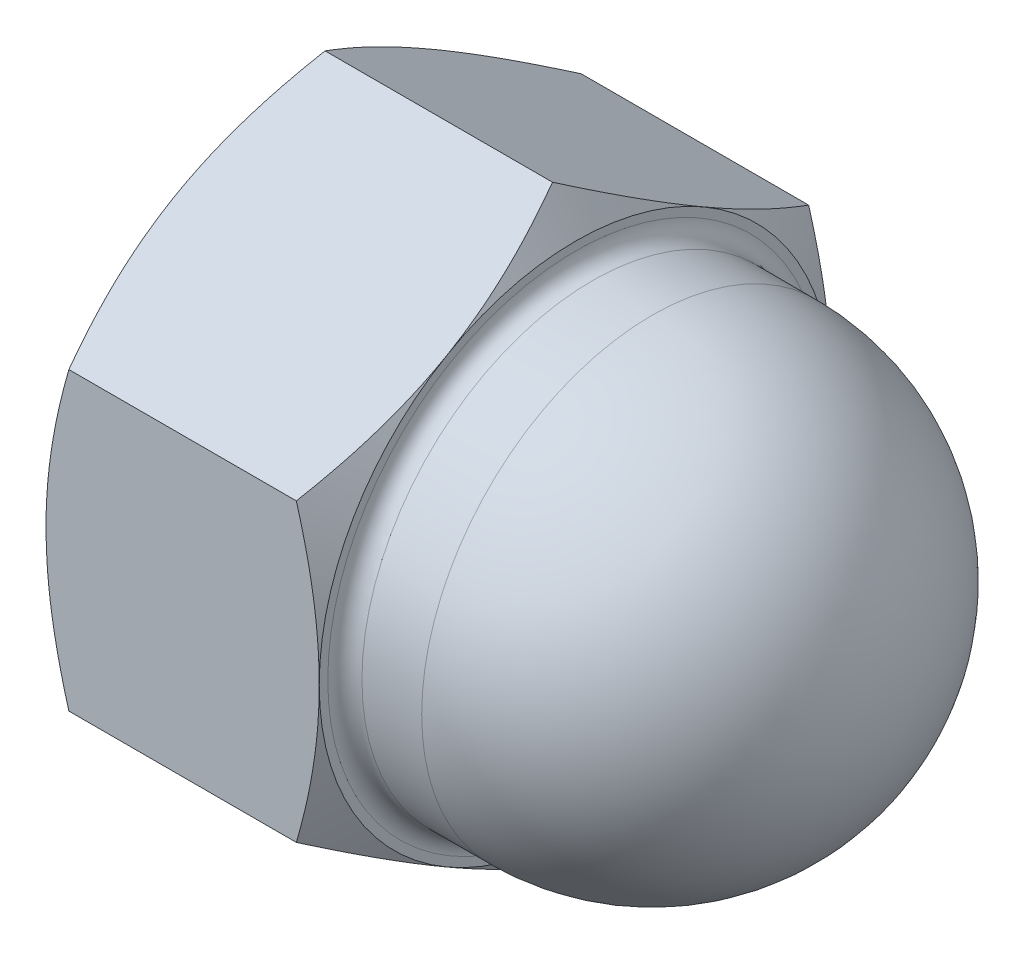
ISO-10303-21;
HEADER;
FILE_DESCRIPTION(('STEP AP214'),'2;1');
FILE_NAME('part.step','',(''),(''),'','','');
FILE_SCHEMA(('AUTOMOTIVE_DESIGN { 1 0 10303 214 1 1 1 1 }'));
ENDSEC;
DATA;
#1=APPLICATION_CONTEXT('core data for automotive mechanical design processes');
#2=APPLICATION_PROTOCOL_DEFINITION('international standard','automotive_design',2000,#1);
#3=PRODUCT_CONTEXT('',#1,'mechanical');
#4=PRODUCT('Part','Part','',(#3));
#5=PRODUCT_RELATED_PRODUCT_CATEGORY('part','',(#4));
#6=PRODUCT_DEFINITION_FORMATION('','',#4);
#7=PRODUCT_DEFINITION_CONTEXT('part definition',#1,'design');
#8=PRODUCT_DEFINITION('design','',#6,#7);
#9=PRODUCT_DEFINITION_SHAPE('','',#8);
#10=(LENGTH_UNIT() NAMED_UNIT(*) SI_UNIT(.MILLI.,.METRE.));
#11=(NAMED_UNIT(*) PLANE_ANGLE_UNIT() SI_UNIT($,.RADIAN.));
#12=(NAMED_UNIT(*) SI_UNIT($,.STERADIAN.) SOLID_ANGLE_UNIT());
#13=UNCERTAINTY_MEASURE_WITH_UNIT(LENGTH_MEASURE(1.E-05),#10,'distance_accuracy_value','');
#14=(GEOMETRIC_REPRESENTATION_CONTEXT(3) GLOBAL_UNCERTAINTY_ASSIGNED_CONTEXT((#13)) GLOBAL_UNIT_ASSIGNED_CONTEXT((#10,
#11,#12)) REPRESENTATION_CONTEXT('',''));
#15=CARTESIAN_POINT('',(0.,0.,0.));
#16=DIRECTION('',(0.,0.,1.));
#17=DIRECTION('',(1.,0.,0.));
#18=AXIS2_PLACEMENT_3D('',#15,#16,#17);
#19=CARTESIAN_POINT('',(16.,17.3205080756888,0.));
#20=DIRECTION('',(-1.,0.,0.));
#21=DIRECTION('',(0.,0.,1.));
#22=AXIS2_PLACEMENT_3D('',#19,#20,#21);
#23=PLANE('',#22);
#24=CARTESIAN_POINT('',(16.,0.,0.));
#25=DIRECTION('',(-1.,0.,0.));
#26=DIRECTION('',(0.,0.,1.));
#27=AXIS2_PLACEMENT_3D('',#24,#25,#26);
#28=CIRCLE('',#27,14.5);
#29=CARTESIAN_POINT('',(16.,0.,14.5));
#30=VERTEX_POINT('',#29);
#31=EDGE_CURVE('E11',#30,#30,#28,.T.);
#32=ORIENTED_EDGE('',*,*,#31,.T.);
#33=EDGE_LOOP('',(#32));
#34=FACE_BOUND('',#33,.T.);
#35=CARTESIAN_POINT('',(16.,0.,0.));
#36=DIRECTION('',(-1.,0.,0.));
#37=DIRECTION('',(0.,0.,1.));
#38=AXIS2_PLACEMENT_3D('',#35,#36,#37);
#39=CIRCLE('',#38,15.);
#40=CARTESIAN_POINT('',(16.,0.,15.));
#41=VERTEX_POINT('',#40);
#42=CARTESIAN_POINT('',(16.,12.9903810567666,7.49999999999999));
#43=VERTEX_POINT('',#42);
#44=EDGE_CURVE('E378',#41,#43,#39,.T.);
#45=ORIENTED_EDGE('',*,*,#44,.F.);
#46=CARTESIAN_POINT('',(16.,0.,0.));
#47=DIRECTION('',(-1.,0.,0.));
#48=DIRECTION('',(0.,0.,1.));
#49=AXIS2_PLACEMENT_3D('',#46,#47,#48);
#50=CIRCLE('',#49,15.);
#51=CARTESIAN_POINT('',(16.,-12.9903810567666,7.50000000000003));
#52=VERTEX_POINT('',#51);
#53=EDGE_CURVE('E340',#52,#41,#50,.T.);
#54=ORIENTED_EDGE('',*,*,#53,.F.);
#55=CARTESIAN_POINT('',(16.,-12.9903810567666,-7.49999999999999));
#56=VERTEX_POINT('',#55);
#57=EDGE_CURVE('E337',#56,#52,#50,.T.);
#58=ORIENTED_EDGE('',*,*,#57,.F.);
#59=CARTESIAN_POINT('',(16.,0.,-15.));
#60=VERTEX_POINT('',#59);
#61=EDGE_CURVE('E365',#60,#56,#50,.T.);
#62=ORIENTED_EDGE('',*,*,#61,.F.);
#63=CARTESIAN_POINT('',(16.,12.9903810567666,-7.50000000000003));
#64=VERTEX_POINT('',#63);
#65=EDGE_CURVE('E356',#64,#60,#50,.T.);
#66=ORIENTED_EDGE('',*,*,#65,.F.);
#67=EDGE_CURVE('E341',#43,#64,#50,.T.);
#68=ORIENTED_EDGE('',*,*,#67,.F.);
#69=EDGE_LOOP('',(#45,#54,#58,#62,#66,#68));
#70=FACE_BOUND('',#69,.T.);
#71=ADVANCED_FACE('F44',(#34,#70),#23,.F.);
#72=CARTESIAN_POINT('',(0.,0.,0.));
#73=DIRECTION('',(-1.,0.,0.));
#74=DIRECTION('',(0.,0.,1.));
#75=AXIS2_PLACEMENT_3D('',#72,#73,#74);
#76=CYLINDRICAL_SURFACE('',#75,13.5);
#77=CARTESIAN_POINT('',(17.,0.,0.));
#78=DIRECTION('',(-1.,0.,0.));
#79=DIRECTION('',(0.,0.,1.));
#80=AXIS2_PLACEMENT_3D('',#77,#78,#79);
#81=CIRCLE('',#80,13.5);
#82=CARTESIAN_POINT('',(17.,0.,13.5));
#83=VERTEX_POINT('',#82);
#84=EDGE_CURVE('E52',#83,#83,#81,.F.);
#85=ORIENTED_EDGE('',*,*,#84,.T.);
#86=EDGE_LOOP('',(#85));
#87=FACE_BOUND('',#86,.T.);
#88=CARTESIAN_POINT('',(20.5,0.,0.));
#89=DIRECTION('',(-1.,0.,0.));
#90=DIRECTION('',(0.,0.,1.));
#91=AXIS2_PLACEMENT_3D('',#88,#89,#90);
#92=CIRCLE('',#91,13.5);
#93=CARTESIAN_POINT('',(20.5,0.,13.5));
#94=VERTEX_POINT('',#93);
#95=EDGE_CURVE('E311',#94,#94,#92,.T.);
#96=ORIENTED_EDGE('',*,*,#95,.T.);
#97=EDGE_LOOP('',(#96));
#98=FACE_BOUND('',#97,.T.);
#99=ADVANCED_FACE('F159',(#87,#98),#76,.T.);
#100=CARTESIAN_POINT('',(20.5,0.,0.));
#101=DIRECTION('',(-1.,0.,0.));
#102=DIRECTION('',(0.,1.,0.));
#103=AXIS2_PLACEMENT_3D('',#100,#101,#102);
#104=SPHERICAL_SURFACE('',#103,13.5);
#105=ORIENTED_EDGE('',*,*,#95,.F.);
#106=EDGE_LOOP('',(#105));
#107=FACE_BOUND('',#106,.T.);
#108=ADVANCED_FACE('F166',(#107),#104,.T.);
#109=CARTESIAN_POINT('',(13.2168783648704,0.,0.));
#110=DIRECTION('',(-1.,0.,0.));
#111=DIRECTION('',(0.,0.,1.));
#112=AXIS2_PLACEMENT_3D('',#109,#110,#111);
#113=CONICAL_SURFACE('',#112,19.8205080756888,1.0471975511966);
#114=CARTESIAN_POINT('',(8.72490551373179,-23.1690741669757,15.));
#115=CARTESIAN_POINT('',(8.88346375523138,-22.8419055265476,15.));
#116=CARTESIAN_POINT('',(9.04122421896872,-22.5143504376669,15.));
#117=CARTESIAN_POINT('',(9.35496872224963,-21.8583866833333,15.));
#118=CARTESIAN_POINT('',(9.5109527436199,-21.5299780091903,15.));
#119=CARTESIAN_POINT('',(9.97601055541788,-20.5432618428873,15.));
#120=CARTESIAN_POINT('',(10.2821423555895,-19.8835624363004,15.));
#121=CARTESIAN_POINT('',(10.8863599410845,-18.5560823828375,15.));
#122=CARTESIAN_POINT('',(11.1843920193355,-17.8882772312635,15.));
#123=CARTESIAN_POINT('',(11.7681393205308,-16.5473234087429,15.));
#124=CARTESIAN_POINT('',(12.0538551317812,-15.8741749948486,15.));
#125=CARTESIAN_POINT('',(12.6184951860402,-14.5000785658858,15.));
#126=CARTESIAN_POINT('',(12.8969197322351,-13.7989241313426,15.));
#127=CARTESIAN_POINT('',(13.4324703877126,-12.3883726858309,15.));
#128=CARTESIAN_POINT('',(13.6895940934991,-11.6789747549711,15.));
#129=CARTESIAN_POINT('',(14.1757206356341,-10.2521895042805,15.));
#130=CARTESIAN_POINT('',(14.4047812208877,-9.53482202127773,15.));
#131=CARTESIAN_POINT('',(14.8273819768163,-8.08972904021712,15.));
#132=CARTESIAN_POINT('',(15.0209334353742,-7.36200691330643,15.));
#133=CARTESIAN_POINT('',(15.2770501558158,-6.26455118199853,15.));
#134=CARTESIAN_POINT('',(15.3565523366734,-5.89874555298,15.));
#135=CARTESIAN_POINT('',(15.5031975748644,-5.16465247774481,15.));
#136=CARTESIAN_POINT('',(15.5703408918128,-4.79636508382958,15.));
#137=CARTESIAN_POINT('',(15.691077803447,-4.05756782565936,15.));
#138=CARTESIAN_POINT('',(15.7446715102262,-3.68705797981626,15.));
#139=CARTESIAN_POINT('',(15.8372361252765,-2.94421917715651,15.));
#140=CARTESIAN_POINT('',(15.8762076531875,-2.57189029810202,15.));
#141=CARTESIAN_POINT('',(15.9382707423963,-1.83075081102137,15.));
#142=CARTESIAN_POINT('',(15.961561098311,-1.46195695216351,15.));
#143=CARTESIAN_POINT('',(15.992531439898,-0.723715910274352,15.));
#144=CARTESIAN_POINT('',(16.000211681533,-0.35426873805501,15.));
#145=CARTESIAN_POINT('',(15.999779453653,0.384620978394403,15.));
#146=CARTESIAN_POINT('',(15.9916668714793,0.754063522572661,15.));
#147=CARTESIAN_POINT('',(15.9598452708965,1.49227999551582,15.));
#148=CARTESIAN_POINT('',(15.9361355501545,1.86105389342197,15.));
#149=CARTESIAN_POINT('',(15.8606650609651,2.75020108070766,15.));
#150=CARTESIAN_POINT('',(15.8013447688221,3.26994378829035,15.));
#151=CARTESIAN_POINT('',(15.6549761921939,4.30551289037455,15.));
#152=CARTESIAN_POINT('',(15.5679240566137,4.82133873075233,15.));
#153=CARTESIAN_POINT('',(15.3691887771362,5.84860326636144,15.));
#154=CARTESIAN_POINT('',(15.2574861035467,6.36003814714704,15.));
#155=CARTESIAN_POINT('',(15.0128532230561,7.37774872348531,15.));
#156=CARTESIAN_POINT('',(14.8799233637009,7.88402450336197,15.));
#157=CARTESIAN_POINT('',(14.5929500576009,8.90245513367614,15.));
#158=CARTESIAN_POINT('',(14.4385092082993,9.41449722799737,15.));
#159=CARTESIAN_POINT('',(14.113878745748,10.4335364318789,15.));
#160=CARTESIAN_POINT('',(13.9436890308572,10.9405335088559,15.));
#161=CARTESIAN_POINT('',(13.5902447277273,11.9497365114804,15.));
#162=CARTESIAN_POINT('',(13.406994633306,12.4519440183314,15.));
#163=CARTESIAN_POINT('',(13.0295649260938,13.4522120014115,15.));
#164=CARTESIAN_POINT('',(12.8353854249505,13.9502725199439,15.));
#165=CARTESIAN_POINT('',(12.3752305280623,15.0992288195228,15.));
#166=CARTESIAN_POINT('',(12.105925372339,15.7487887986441,15.));
#167=CARTESIAN_POINT('',(11.5547925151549,17.0425896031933,15.));
#168=CARTESIAN_POINT('',(11.2729641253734,17.6868301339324,15.));
#169=CARTESIAN_POINT('',(10.6992189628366,18.9709471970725,15.));
#170=CARTESIAN_POINT('',(10.4073001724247,19.6108228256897,15.));
#171=CARTESIAN_POINT('',(9.81534813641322,20.8867861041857,15.));
#172=CARTESIAN_POINT('',(9.51531504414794,21.522873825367,15.));
#173=CARTESIAN_POINT('',(8.90830232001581,22.7925136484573,15.));
#174=CARTESIAN_POINT('',(8.60131594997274,23.4260625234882,15.));
#175=CARTESIAN_POINT('',(7.98185068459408,24.6904686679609,15.));
#176=CARTESIAN_POINT('',(7.66937176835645,25.3213259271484,15.));
#177=CARTESIAN_POINT('',(7.03987592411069,26.580678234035,15.));
#178=CARTESIAN_POINT('',(6.72285952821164,27.2091735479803,15.));
#179=CARTESIAN_POINT('',(6.08497726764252,28.4642087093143,15.));
#180=CARTESIAN_POINT('',(5.76411138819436,29.0907485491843,15.));
#181=CARTESIAN_POINT('',(4.84852370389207,30.8671956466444,15.));
#182=CARTESIAN_POINT('',(4.24993335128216,32.0151090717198,15.));
#183=CARTESIAN_POINT('',(3.04449894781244,34.3066304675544,15.));
#184=CARTESIAN_POINT('',(2.43765463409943,35.4502382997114,15.));
#185=CARTESIAN_POINT('',(1.2190415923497,37.73139285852,15.));
#186=CARTESIAN_POINT('',(0.60728767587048,38.868947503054,15.));
#187=CARTESIAN_POINT('',(-0.314051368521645,40.5732346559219,15.));
#188=CARTESIAN_POINT('',(-0.621774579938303,41.1409752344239,15.));
#189=CARTESIAN_POINT('',(-1.23833467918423,42.275850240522,15.));
#190=CARTESIAN_POINT('',(-1.54717156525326,42.8429846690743,15.));
#191=CARTESIAN_POINT('',(-1.85650205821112,43.4098498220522,15.));
#192=B_SPLINE_CURVE_WITH_KNOTS('',3,(#114,#115,#116,#117,#118,#119,#120,#121,#122,#123,#124,
#125,#126,#127,#128,#129,#130,#131,#132,#133,#134,#135,#136,#137,#138,#139,#140,#141,#142,#143,
#144,#145,#146,#147,#148,#149,#150,#151,#152,#153,#154,#155,#156,#157,#158,#159,#160,#161,#162,
#163,#164,#165,#166,#167,#168,#169,#170,#171,#172,#173,#174,#175,#176,#177,#178,#179,#180,#181,
#182,#183,#184,#185,#186,#187,#188,#189,#190,#191),.UNSPECIFIED.,.F.,.F.,(4,2,2,2,2,2,2,2,2,2,2,
2,2,2,2,2,2,2,2,2,2,2,2,2,2,2,2,2,2,2,2,2,2,2,2,2,2,2,4),(0.,1.09069516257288,2.18140147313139,
4.36314172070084,6.55691851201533,8.75059039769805,11.0135627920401,13.2767901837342,
15.5352791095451,17.7930488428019,18.9159095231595,20.0387466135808,21.1615744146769,
22.2843546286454,23.3926186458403,24.5008644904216,25.6091182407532,26.7174218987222,
28.2859027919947,29.8546015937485,31.4245477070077,32.9944681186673,34.5986435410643,
36.2028293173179,37.8064657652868,39.4100858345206,41.5194319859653,43.6288942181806,
45.7387807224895,47.8486273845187,49.9606143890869,52.0726094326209,54.1843587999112,
56.2961162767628,60.1798964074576,64.063800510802,67.9386334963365,69.8759519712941,
71.8132673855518),.UNSPECIFIED.);
#193=CARTESIAN_POINT('',(14.6602540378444,-8.66025403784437,15.));
#194=VERTEX_POINT('',#193);
#195=EDGE_CURVE('E253',#41,#194,#192,.F.);
#196=ORIENTED_EDGE('',*,*,#195,.T.);
#197=CARTESIAN_POINT('',(14.6601873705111,-8.66013856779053,15.0002));
#198=CARTESIAN_POINT('',(14.7700782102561,-8.85048754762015,14.6705058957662));
#199=CARTESIAN_POINT('',(14.8749824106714,-9.04157899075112,14.3395258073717));
#200=CARTESIAN_POINT('',(15.0734314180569,-9.42529420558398,13.674911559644));
#201=CARTESIAN_POINT('',(15.1669724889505,-9.617918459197,13.3412765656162));
#202=CARTESIAN_POINT('',(15.3414378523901,-10.0050715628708,12.6707077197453));
#203=CARTESIAN_POINT('',(15.4223322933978,-10.199603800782,12.333767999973));
#204=CARTESIAN_POINT('',(15.569767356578,-10.5900200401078,11.6575472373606));
#205=CARTESIAN_POINT('',(15.6363087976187,-10.7859039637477,11.3182663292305));
#206=CARTESIAN_POINT('',(15.7522076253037,-11.1740042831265,10.6460568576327));
#207=CARTESIAN_POINT('',(15.8019486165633,-11.3661918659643,10.3131781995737));
#208=CARTESIAN_POINT('',(15.8853532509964,-11.7514476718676,9.64589556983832));
#209=CARTESIAN_POINT('',(15.9190165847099,-11.9445159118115,9.31149156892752));
#210=CARTESIAN_POINT('',(15.9694159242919,-12.3309767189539,8.64212181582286));
#211=CARTESIAN_POINT('',(15.9861720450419,-12.5243686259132,8.30715720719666));
#212=CARTESIAN_POINT('',(16.002396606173,-12.9113309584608,7.63691878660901));
#213=CARTESIAN_POINT('',(16.0018655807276,-13.1049013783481,7.30164498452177));
#214=CARTESIAN_POINT('',(15.9847233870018,-13.4667798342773,6.67485311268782));
#215=CARTESIAN_POINT('',(15.970203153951,-13.6351136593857,6.38329037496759));
#216=CARTESIAN_POINT('',(15.9283628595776,-13.9713941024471,5.80083556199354));
#217=CARTESIAN_POINT('',(15.9010418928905,-14.1393406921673,5.50994353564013));
#218=CARTESIAN_POINT('',(15.8340764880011,-14.4747554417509,4.92898814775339));
#219=CARTESIAN_POINT('',(15.7944218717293,-14.6422230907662,4.63892567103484));
#220=CARTESIAN_POINT('',(15.7034848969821,-14.9763732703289,4.06016058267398));
#221=CARTESIAN_POINT('',(15.6522017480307,-15.1430557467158,3.77145806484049));
#222=CARTESIAN_POINT('',(15.4796131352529,-15.6490296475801,2.89508556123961));
#223=CARTESIAN_POINT('',(15.3410988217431,-15.9868558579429,2.30995340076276));
#224=CARTESIAN_POINT('',(15.0267280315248,-16.6574708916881,1.14841408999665));
#225=CARTESIAN_POINT('',(14.8509453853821,-16.9902683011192,0.571992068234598));
#226=CARTESIAN_POINT('',(14.6601873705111,-17.3206235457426,-0.000199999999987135));
#227=B_SPLINE_CURVE_WITH_KNOTS('',3,(#197,#198,#199,#200,#201,#202,#203,#204,#205,#206,#207,
#208,#209,#210,#211,#212,#213,#214,#215,#216,#217,#218,#219,#220,#221,#222,#223,#224,#225,#226),
.UNSPECIFIED.,.F.,.F.,(4,2,2,2,2,2,2,2,2,2,2,2,2,2,4),(0.,1.18875411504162,2.37789802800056,
3.56980778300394,4.76164951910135,5.92407379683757,7.0865204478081,8.24758247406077,
9.40860862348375,10.4193068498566,11.4300765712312,12.4416826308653,13.4533574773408,
15.5211962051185,17.5849760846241),.UNSPECIFIED.);
#228=EDGE_CURVE('E251',#194,#52,#227,.T.);
#229=ORIENTED_EDGE('',*,*,#228,.T.);
#230=ORIENTED_EDGE('',*,*,#53,.T.);
#231=EDGE_LOOP('',(#196,#229,#230));
#232=FACE_BOUND('',#231,.T.);
#233=ADVANCED_FACE('F372',(#232),#113,.T.);
#234=CARTESIAN_POINT('',(14.6602540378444,-17.3205080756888,0.));
#235=VERTEX_POINT('',#234);
#236=EDGE_CURVE('E244',#52,#235,#227,.T.);
#237=ORIENTED_EDGE('',*,*,#236,.T.);
#238=CARTESIAN_POINT('',(14.6601873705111,-17.3206235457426,0.000200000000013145));
#239=CARTESIAN_POINT('',(14.7700782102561,-17.130274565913,-0.329494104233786));
#240=CARTESIAN_POINT('',(14.8749824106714,-16.939183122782,-0.660474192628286));
#241=CARTESIAN_POINT('',(15.0734314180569,-16.5554679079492,-1.325088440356));
#242=CARTESIAN_POINT('',(15.1669724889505,-16.3628436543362,-1.65872343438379));
#243=CARTESIAN_POINT('',(15.3414378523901,-15.9756905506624,-2.32929228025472));
#244=CARTESIAN_POINT('',(15.4223322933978,-15.7811583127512,-2.666232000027));
#245=CARTESIAN_POINT('',(15.5697673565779,-15.3907420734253,-3.34245276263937));
#246=CARTESIAN_POINT('',(15.6363087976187,-15.1948581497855,-3.6817336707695));
#247=CARTESIAN_POINT('',(15.7522076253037,-14.8067578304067,-4.35394314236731));
#248=CARTESIAN_POINT('',(15.8019486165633,-14.6145702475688,-4.68682180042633));
#249=CARTESIAN_POINT('',(15.8853532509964,-14.2293144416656,-5.35410443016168));
#250=CARTESIAN_POINT('',(15.9190165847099,-14.0362462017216,-5.68850843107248));
#251=CARTESIAN_POINT('',(15.9694159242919,-13.6497853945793,-6.35787818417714));
#252=CARTESIAN_POINT('',(15.9861720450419,-13.4563934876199,-6.69284279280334));
#253=CARTESIAN_POINT('',(16.002396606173,-13.0694311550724,-7.363081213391));
#254=CARTESIAN_POINT('',(16.0018655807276,-12.8758607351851,-7.69835501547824));
#255=CARTESIAN_POINT('',(15.9847233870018,-12.5139822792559,-8.32514688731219));
#256=CARTESIAN_POINT('',(15.970203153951,-12.3456484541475,-8.61670962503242));
#257=CARTESIAN_POINT('',(15.9283628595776,-12.0093680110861,-9.19916443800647));
#258=CARTESIAN_POINT('',(15.9010418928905,-11.8414214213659,-9.49005646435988));
#259=CARTESIAN_POINT('',(15.8340764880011,-11.5060066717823,-10.0710118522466));
#260=CARTESIAN_POINT('',(15.7944218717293,-11.338539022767,-10.3610743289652));
#261=CARTESIAN_POINT('',(15.7034848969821,-11.0043888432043,-10.939839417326));
#262=CARTESIAN_POINT('',(15.6522017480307,-10.8377063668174,-11.2285419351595));
#263=CARTESIAN_POINT('',(15.4796131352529,-10.3317324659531,-12.1049144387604));
#264=CARTESIAN_POINT('',(15.3410988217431,-9.99390625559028,-12.6900465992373));
#265=CARTESIAN_POINT('',(15.0267280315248,-9.32329122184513,-13.8515859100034));
#266=CARTESIAN_POINT('',(14.8509453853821,-8.99049381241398,-14.4280079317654));
#267=CARTESIAN_POINT('',(14.6601873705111,-8.66013856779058,-15.0002));
#268=B_SPLINE_CURVE_WITH_KNOTS('',3,(#238,#239,#240,#241,#242,#243,#244,#245,#246,#247,#248,
#249,#250,#251,#252,#253,#254,#255,#256,#257,#258,#259,#260,#261,#262,#263,#264,#265,#266,#267),
.UNSPECIFIED.,.F.,.F.,(4,2,2,2,2,2,2,2,2,2,2,2,2,2,4),(0.,1.18875411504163,2.37789802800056,
3.56980778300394,4.76164951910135,5.92407379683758,7.08652044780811,8.24758247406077,
9.40860862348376,10.4193068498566,11.4300765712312,12.4416826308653,13.4533574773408,
15.5211962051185,17.5849760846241),.UNSPECIFIED.);
#269=EDGE_CURVE('E255',#235,#56,#268,.T.);
#270=ORIENTED_EDGE('',*,*,#269,.T.);
#271=ORIENTED_EDGE('',*,*,#57,.T.);
#272=EDGE_LOOP('',(#237,#270,#271));
#273=FACE_BOUND('',#272,.T.);
#274=ADVANCED_FACE('F370',(#273),#113,.T.);
#275=CARTESIAN_POINT('',(14.6602540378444,-8.66025403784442,-15.));
#276=VERTEX_POINT('',#275);
#277=EDGE_CURVE('E236',#56,#276,#268,.T.);
#278=ORIENTED_EDGE('',*,*,#277,.T.);
#279=CARTESIAN_POINT('',(8.72490551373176,-23.1690741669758,-15.));
#280=CARTESIAN_POINT('',(8.88346375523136,-22.8419055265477,-15.));
#281=CARTESIAN_POINT('',(9.0412242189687,-22.5143504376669,-15.));
#282=CARTESIAN_POINT('',(9.3549687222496,-21.8583866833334,-15.));
#283=CARTESIAN_POINT('',(9.51095274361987,-21.5299780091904,-15.));
#284=CARTESIAN_POINT('',(9.97601055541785,-20.5432618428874,-15.));
#285=CARTESIAN_POINT('',(10.2821423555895,-19.8835624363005,-15.));
#286=CARTESIAN_POINT('',(10.8863599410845,-18.5560823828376,-15.));
#287=CARTESIAN_POINT('',(11.1843920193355,-17.8882772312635,-15.));
#288=CARTESIAN_POINT('',(11.7681393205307,-16.5473234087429,-15.));
#289=CARTESIAN_POINT('',(12.0538551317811,-15.8741749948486,-15.));
#290=CARTESIAN_POINT('',(12.6184951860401,-14.5000785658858,-15.));
#291=CARTESIAN_POINT('',(12.8969197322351,-13.7989241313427,-15.));
#292=CARTESIAN_POINT('',(13.4324703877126,-12.3883726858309,-15.));
#293=CARTESIAN_POINT('',(13.6895940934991,-11.6789747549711,-15.));
#294=CARTESIAN_POINT('',(14.1757206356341,-10.2521895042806,-15.));
#295=CARTESIAN_POINT('',(14.4047812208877,-9.53482202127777,-15.));
#296=CARTESIAN_POINT('',(14.8273819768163,-8.08972904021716,-15.));
#297=CARTESIAN_POINT('',(15.0209334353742,-7.36200691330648,-15.));
#298=CARTESIAN_POINT('',(15.2770501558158,-6.26455118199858,-15.));
#299=CARTESIAN_POINT('',(15.3565523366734,-5.89874555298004,-15.));
#300=CARTESIAN_POINT('',(15.5031975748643,-5.16465247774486,-15.));
#301=CARTESIAN_POINT('',(15.5703408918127,-4.79636508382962,-15.));
#302=CARTESIAN_POINT('',(15.691077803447,-4.0575678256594,-15.));
#303=CARTESIAN_POINT('',(15.7446715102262,-3.6870579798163,-15.));
#304=CARTESIAN_POINT('',(15.8372361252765,-2.94421917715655,-15.));
#305=CARTESIAN_POINT('',(15.8762076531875,-2.57189029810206,-15.));
#306=CARTESIAN_POINT('',(15.9382707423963,-1.83075081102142,-15.));
#307=CARTESIAN_POINT('',(15.961561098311,-1.46195695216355,-15.));
#308=CARTESIAN_POINT('',(15.992531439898,-0.723715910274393,-15.));
#309=CARTESIAN_POINT('',(16.000211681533,-0.354268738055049,-15.));
#310=CARTESIAN_POINT('',(15.999779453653,0.384620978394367,-15.));
#311=CARTESIAN_POINT('',(15.9916668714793,0.754063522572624,-15.));
#312=CARTESIAN_POINT('',(15.9598452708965,1.49227999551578,-15.));
#313=CARTESIAN_POINT('',(15.9361355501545,1.86105389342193,-15.));
#314=CARTESIAN_POINT('',(15.8606650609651,2.75020108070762,-15.));
#315=CARTESIAN_POINT('',(15.8013447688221,3.2699437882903,-15.));
#316=CARTESIAN_POINT('',(15.6549761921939,4.30551289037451,-15.));
#317=CARTESIAN_POINT('',(15.5679240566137,4.82133873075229,-15.));
#318=CARTESIAN_POINT('',(15.3691887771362,5.84860326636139,-15.));
#319=CARTESIAN_POINT('',(15.2574861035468,6.36003814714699,-15.));
#320=CARTESIAN_POINT('',(15.0128532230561,7.37774872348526,-15.));
#321=CARTESIAN_POINT('',(14.879923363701,7.88402450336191,-15.));
#322=CARTESIAN_POINT('',(14.5929500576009,8.90245513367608,-15.));
#323=CARTESIAN_POINT('',(14.4385092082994,9.41449722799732,-15.));
#324=CARTESIAN_POINT('',(14.1138787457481,10.4335364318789,-15.));
#325=CARTESIAN_POINT('',(13.9436890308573,10.9405335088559,-15.));
#326=CARTESIAN_POINT('',(13.5902447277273,11.9497365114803,-15.));
#327=CARTESIAN_POINT('',(13.406994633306,12.4519440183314,-15.));
#328=CARTESIAN_POINT('',(13.0295649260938,13.4522120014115,-15.));
#329=CARTESIAN_POINT('',(12.8353854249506,13.9502725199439,-15.));
#330=CARTESIAN_POINT('',(12.3752305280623,15.0992288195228,-15.));
#331=CARTESIAN_POINT('',(12.105925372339,15.748788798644,-15.));
#332=CARTESIAN_POINT('',(11.5547925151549,17.0425896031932,-15.));
#333=CARTESIAN_POINT('',(11.2729641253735,17.6868301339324,-15.));
#334=CARTESIAN_POINT('',(10.6992189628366,18.9709471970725,-15.));
#335=CARTESIAN_POINT('',(10.4073001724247,19.6108228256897,-15.));
#336=CARTESIAN_POINT('',(9.81534813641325,20.8867861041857,-15.));
#337=CARTESIAN_POINT('',(9.51531504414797,21.522873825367,-15.));
#338=CARTESIAN_POINT('',(8.90830232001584,22.7925136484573,-15.));
#339=CARTESIAN_POINT('',(8.60131594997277,23.4260625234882,-15.));
#340=CARTESIAN_POINT('',(7.98185068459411,24.6904686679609,-15.));
#341=CARTESIAN_POINT('',(7.66937176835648,25.3213259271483,-15.));
#342=CARTESIAN_POINT('',(7.03987592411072,26.5806782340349,-15.));
#343=CARTESIAN_POINT('',(6.72285952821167,27.2091735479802,-15.));
#344=CARTESIAN_POINT('',(6.08497726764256,28.4642087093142,-15.));
#345=CARTESIAN_POINT('',(5.76411138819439,29.0907485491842,-15.));
#346=CARTESIAN_POINT('',(4.84852370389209,30.8671956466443,-15.));
#347=CARTESIAN_POINT('',(4.24993335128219,32.0151090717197,-15.));
#348=CARTESIAN_POINT('',(3.04449894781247,34.3066304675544,-15.));
#349=CARTESIAN_POINT('',(2.43765463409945,35.4502382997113,-15.));
#350=CARTESIAN_POINT('',(1.21904159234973,37.73139285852,-15.));
#351=CARTESIAN_POINT('',(0.607287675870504,38.8689475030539,-15.));
#352=CARTESIAN_POINT('',(-0.314051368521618,40.5732346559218,-15.));
#353=CARTESIAN_POINT('',(-0.621774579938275,41.1409752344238,-15.));
#354=CARTESIAN_POINT('',(-1.2383346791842,42.2758502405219,-15.));
#355=CARTESIAN_POINT('',(-1.54717156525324,42.8429846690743,-15.));
#356=CARTESIAN_POINT('',(-1.85650205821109,43.4098498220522,-15.));
#357=B_SPLINE_CURVE_WITH_KNOTS('',3,(#279,#280,#281,#282,#283,#284,#285,#286,#287,#288,#289,
#290,#291,#292,#293,#294,#295,#296,#297,#298,#299,#300,#301,#302,#303,#304,#305,#306,#307,#308,
#309,#310,#311,#312,#313,#314,#315,#316,#317,#318,#319,#320,#321,#322,#323,#324,#325,#326,#327,
#328,#329,#330,#331,#332,#333,#334,#335,#336,#337,#338,#339,#340,#341,#342,#343,#344,#345,#346,
#347,#348,#349,#350,#351,#352,#353,#354,#355,#356),.UNSPECIFIED.,.F.,.F.,(4,2,2,2,2,2,2,2,2,2,2,
2,2,2,2,2,2,2,2,2,2,2,2,2,2,2,2,2,2,2,2,2,2,2,2,2,2,2,4),(0.,1.09069516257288,2.18140147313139,
4.36314172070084,6.55691851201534,8.75059039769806,11.0135627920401,13.2767901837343,
15.5352791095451,17.7930488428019,18.9159095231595,20.0387466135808,21.1615744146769,
22.2843546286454,23.3926186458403,24.5008644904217,25.6091182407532,26.7174218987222,
28.2859027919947,29.8546015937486,31.4245477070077,32.9944681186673,34.5986435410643,
36.2028293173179,37.8064657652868,39.4100858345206,41.5194319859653,43.6288942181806,
45.7387807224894,47.8486273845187,49.9606143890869,52.0726094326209,54.1843587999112,
56.2961162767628,60.1798964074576,64.0638005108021,67.9386334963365,69.8759519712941,
71.8132673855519),.UNSPECIFIED.);
#358=EDGE_CURVE('E68',#60,#276,#357,.F.);
#359=ORIENTED_EDGE('',*,*,#358,.F.);
#360=ORIENTED_EDGE('',*,*,#61,.T.);
#361=EDGE_LOOP('',(#278,#359,#360));
#362=FACE_BOUND('',#361,.T.);
#363=ADVANCED_FACE('F222',(#362),#113,.T.);
#364=CARTESIAN_POINT('',(14.6601873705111,8.66013856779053,-15.0002));
#365=CARTESIAN_POINT('',(14.7700782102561,8.85048754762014,-14.6705058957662));
#366=CARTESIAN_POINT('',(14.8749824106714,9.04157899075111,-14.3395258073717));
#367=CARTESIAN_POINT('',(15.0734314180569,9.42529420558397,-13.674911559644));
#368=CARTESIAN_POINT('',(15.1669724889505,9.61791845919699,-13.3412765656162));
#369=CARTESIAN_POINT('',(15.3414378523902,10.0050715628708,-12.6707077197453));
#370=CARTESIAN_POINT('',(15.4223322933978,10.199603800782,-12.333767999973));
#371=CARTESIAN_POINT('',(15.569767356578,10.5900200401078,-11.6575472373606));
#372=CARTESIAN_POINT('',(15.6363087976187,10.7859039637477,-11.3182663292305));
#373=CARTESIAN_POINT('',(15.7522076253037,11.1740042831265,-10.6460568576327));
#374=CARTESIAN_POINT('',(15.8019486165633,11.3661918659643,-10.3131781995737));
#375=CARTESIAN_POINT('',(15.8853532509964,11.7514476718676,-9.64589556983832));
#376=CARTESIAN_POINT('',(15.9190165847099,11.9445159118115,-9.31149156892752));
#377=CARTESIAN_POINT('',(15.9694159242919,12.3309767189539,-8.64212181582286));
#378=CARTESIAN_POINT('',(15.9861720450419,12.5243686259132,-8.30715720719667));
#379=CARTESIAN_POINT('',(16.002396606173,12.9113309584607,-7.63691878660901));
#380=CARTESIAN_POINT('',(16.0018655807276,13.104901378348,-7.30164498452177));
#381=CARTESIAN_POINT('',(15.9847233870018,13.4667798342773,-6.67485311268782));
#382=CARTESIAN_POINT('',(15.970203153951,13.6351136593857,-6.38329037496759));
#383=CARTESIAN_POINT('',(15.9283628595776,13.9713941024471,-5.80083556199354));
#384=CARTESIAN_POINT('',(15.9010418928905,14.1393406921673,-5.50994353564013));
#385=CARTESIAN_POINT('',(15.8340764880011,14.4747554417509,-4.92898814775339));
#386=CARTESIAN_POINT('',(15.7944218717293,14.6422230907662,-4.63892567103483));
#387=CARTESIAN_POINT('',(15.7034848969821,14.9763732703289,-4.06016058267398));
#388=CARTESIAN_POINT('',(15.6522017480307,15.1430557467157,-3.77145806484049));
#389=CARTESIAN_POINT('',(15.4796131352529,15.6490296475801,-2.89508556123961));
#390=CARTESIAN_POINT('',(15.3410988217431,15.9868558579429,-2.30995340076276));
#391=CARTESIAN_POINT('',(15.0267280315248,16.6574708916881,-1.14841408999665));
#392=CARTESIAN_POINT('',(14.8509453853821,16.9902683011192,-0.571992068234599));
#393=CARTESIAN_POINT('',(14.6601873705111,17.3206235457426,0.000199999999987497));
#394=B_SPLINE_CURVE_WITH_KNOTS('',3,(#364,#365,#366,#367,#368,#369,#370,#371,#372,#373,#374,
#375,#376,#377,#378,#379,#380,#381,#382,#383,#384,#385,#386,#387,#388,#389,#390,#391,#392,#393),
.UNSPECIFIED.,.F.,.F.,(4,2,2,2,2,2,2,2,2,2,2,2,2,2,4),(0.,1.18875411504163,2.37789802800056,
3.56980778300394,4.76164951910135,5.92407379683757,7.0865204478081,8.24758247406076,
9.40860862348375,10.4193068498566,11.4300765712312,12.4416826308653,13.4533574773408,
15.5211962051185,17.5849760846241),.UNSPECIFIED.);
#395=CARTESIAN_POINT('',(14.6602540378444,8.66025403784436,-15.));
#396=VERTEX_POINT('',#395);
#397=EDGE_CURVE('E204',#396,#64,#394,.T.);
#398=ORIENTED_EDGE('',*,*,#397,.T.);
#399=ORIENTED_EDGE('',*,*,#65,.T.);
#400=EDGE_CURVE('E211',#396,#60,#357,.F.);
#401=ORIENTED_EDGE('',*,*,#400,.F.);
#402=EDGE_LOOP('',(#398,#399,#401));
#403=FACE_BOUND('',#402,.T.);
#404=ADVANCED_FACE('F219',(#403),#113,.T.);
#405=CARTESIAN_POINT('',(14.6601873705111,17.3206235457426,-0.000200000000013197));
#406=CARTESIAN_POINT('',(14.7700782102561,17.130274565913,0.329494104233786));
#407=CARTESIAN_POINT('',(14.8749824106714,16.939183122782,0.660474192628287));
#408=CARTESIAN_POINT('',(15.0734314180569,16.5554679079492,1.32508844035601));
#409=CARTESIAN_POINT('',(15.1669724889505,16.3628436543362,1.65872343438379));
#410=CARTESIAN_POINT('',(15.3414378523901,15.9756905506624,2.32929228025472));
#411=CARTESIAN_POINT('',(15.4223322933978,15.7811583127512,2.666232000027));
#412=CARTESIAN_POINT('',(15.5697673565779,15.3907420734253,3.34245276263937));
#413=CARTESIAN_POINT('',(15.6363087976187,15.1948581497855,3.6817336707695));
#414=CARTESIAN_POINT('',(15.7522076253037,14.8067578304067,4.3539431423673));
#415=CARTESIAN_POINT('',(15.8019486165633,14.6145702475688,4.68682180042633));
#416=CARTESIAN_POINT('',(15.8853532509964,14.2293144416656,5.35410443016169));
#417=CARTESIAN_POINT('',(15.9190165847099,14.0362462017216,5.68850843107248));
#418=CARTESIAN_POINT('',(15.9694159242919,13.6497853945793,6.35787818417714));
#419=CARTESIAN_POINT('',(15.9861720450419,13.4563934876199,6.69284279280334));
#420=CARTESIAN_POINT('',(16.002396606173,13.0694311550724,7.363081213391));
#421=CARTESIAN_POINT('',(16.0018655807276,12.8758607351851,7.69835501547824));
#422=CARTESIAN_POINT('',(15.9847233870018,12.5139822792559,8.32514688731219));
#423=CARTESIAN_POINT('',(15.970203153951,12.3456484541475,8.61670962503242));
#424=CARTESIAN_POINT('',(15.9283628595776,12.0093680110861,9.19916443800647));
#425=CARTESIAN_POINT('',(15.9010418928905,11.8414214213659,9.49005646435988));
#426=CARTESIAN_POINT('',(15.8340764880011,11.5060066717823,10.0710118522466));
#427=CARTESIAN_POINT('',(15.7944218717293,11.338539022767,10.3610743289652));
#428=CARTESIAN_POINT('',(15.7034848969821,11.0043888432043,10.939839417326));
#429=CARTESIAN_POINT('',(15.6522017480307,10.8377063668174,11.2285419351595));
#430=CARTESIAN_POINT('',(15.4796131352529,10.3317324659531,12.1049144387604));
#431=CARTESIAN_POINT('',(15.3410988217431,9.99390625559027,12.6900465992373));
#432=CARTESIAN_POINT('',(15.0267280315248,9.32329122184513,13.8515859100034));
#433=CARTESIAN_POINT('',(14.8509453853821,8.99049381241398,14.4280079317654));
#434=CARTESIAN_POINT('',(14.6601873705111,8.66013856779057,15.0002));
#435=B_SPLINE_CURVE_WITH_KNOTS('',3,(#405,#406,#407,#408,#409,#410,#411,#412,#413,#414,#415,
#416,#417,#418,#419,#420,#421,#422,#423,#424,#425,#426,#427,#428,#429,#430,#431,#432,#433,#434),
.UNSPECIFIED.,.F.,.F.,(4,2,2,2,2,2,2,2,2,2,2,2,2,2,4),(0.,1.18875411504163,2.37789802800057,
3.56980778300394,4.76164951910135,5.92407379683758,7.08652044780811,8.24758247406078,
9.40860862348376,10.4193068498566,11.4300765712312,12.4416826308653,13.4533574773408,
15.5211962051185,17.5849760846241),.UNSPECIFIED.);
#436=CARTESIAN_POINT('',(14.6602540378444,17.3205080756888,0.));
#437=VERTEX_POINT('',#436);
#438=EDGE_CURVE('E58',#437,#43,#435,.T.);
#439=ORIENTED_EDGE('',*,*,#438,.T.);
#440=ORIENTED_EDGE('',*,*,#67,.T.);
#441=EDGE_CURVE('E200',#64,#437,#394,.T.);
#442=ORIENTED_EDGE('',*,*,#441,.T.);
#443=EDGE_LOOP('',(#439,#440,#442));
#444=FACE_BOUND('',#443,.T.);
#445=ADVANCED_FACE('F221',(#444),#113,.T.);
#446=CARTESIAN_POINT('',(14.6602540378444,8.66025403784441,15.));
#447=VERTEX_POINT('',#446);
#448=EDGE_CURVE('E307',#43,#447,#435,.T.);
#449=ORIENTED_EDGE('',*,*,#448,.T.);
#450=EDGE_CURVE('E656',#447,#41,#192,.F.);
#451=ORIENTED_EDGE('',*,*,#450,.T.);
#452=ORIENTED_EDGE('',*,*,#44,.T.);
#453=EDGE_LOOP('',(#449,#451,#452));
#454=FACE_BOUND('',#453,.T.);
#455=ADVANCED_FACE('F182',(#454),#113,.T.);
#456=CARTESIAN_POINT('',(16.,8.66025403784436,-15.));
#457=DIRECTION('',(0.,-0.866025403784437,0.500000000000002));
#458=DIRECTION('',(0.,-0.500000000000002,-0.866025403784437));
#459=AXIS2_PLACEMENT_3D('',#456,#457,#458);
#460=PLANE('',#459);
#461=ORIENTED_EDGE('',*,*,#397,.F.);
#462=DIRECTION('',(-1.,0.,0.));
#463=VECTOR('',#462,1.);
#464=CARTESIAN_POINT('',(16.,8.66025403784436,-15.));
#465=LINE('',#464,#463);
#466=CARTESIAN_POINT('',(1.33974596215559,8.66025403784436,-15.));
#467=VERTEX_POINT('',#466);
#468=EDGE_CURVE('E314',#396,#467,#465,.T.);
#469=ORIENTED_EDGE('',*,*,#468,.T.);
#470=CARTESIAN_POINT('',(1.33981262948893,17.3206235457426,0.000199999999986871));
#471=CARTESIAN_POINT('',(1.22992178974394,17.130274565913,-0.329494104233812));
#472=CARTESIAN_POINT('',(1.12501758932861,16.939183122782,-0.660474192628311));
#473=CARTESIAN_POINT('',(0.926568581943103,16.5554679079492,-1.32508844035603));
#474=CARTESIAN_POINT('',(0.833027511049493,16.3628436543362,-1.65872343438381));
#475=CARTESIAN_POINT('',(0.658562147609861,15.9756905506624,-2.32929228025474));
#476=CARTESIAN_POINT('',(0.577667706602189,15.7811583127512,-2.66623200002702));
#477=CARTESIAN_POINT('',(0.430232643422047,15.3907420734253,-3.34245276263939));
#478=CARTESIAN_POINT('',(0.363691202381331,15.1948581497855,-3.68173367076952));
#479=CARTESIAN_POINT('',(0.247792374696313,14.8067578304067,-4.35394314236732));
#480=CARTESIAN_POINT('',(0.198051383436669,14.6145702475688,-4.68682180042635));
#481=CARTESIAN_POINT('',(0.114646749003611,14.2293144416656,-5.3541044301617));
#482=CARTESIAN_POINT('',(0.0809834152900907,14.0362462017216,-5.6885084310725));
#483=CARTESIAN_POINT('',(0.0305840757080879,13.6497853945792,-6.35787818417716));
#484=CARTESIAN_POINT('',(0.0138279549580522,13.4563934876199,-6.69284279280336));
#485=CARTESIAN_POINT('',(-0.00239660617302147,13.0694311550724,-7.36308121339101));
#486=CARTESIAN_POINT('',(-0.0018655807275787,12.8758607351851,-7.69835501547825));
#487=CARTESIAN_POINT('',(0.0152766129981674,12.5139822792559,-8.32514688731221));
#488=CARTESIAN_POINT('',(0.0297968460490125,12.3456484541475,-8.61670962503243));
#489=CARTESIAN_POINT('',(0.071637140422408,12.0093680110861,-9.19916443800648));
#490=CARTESIAN_POINT('',(0.098958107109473,11.8414214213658,-9.49005646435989));
#491=CARTESIAN_POINT('',(0.1659235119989,11.5060066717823,-10.0710118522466));
#492=CARTESIAN_POINT('',(0.205578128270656,11.338539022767,-10.3610743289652));
#493=CARTESIAN_POINT('',(0.296515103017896,11.0043888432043,-10.939839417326));
#494=CARTESIAN_POINT('',(0.34779825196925,10.8377063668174,-11.2285419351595));
#495=CARTESIAN_POINT('',(0.520386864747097,10.331732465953,-12.1049144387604));
#496=CARTESIAN_POINT('',(0.658901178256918,9.99390625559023,-12.6900465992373));
#497=CARTESIAN_POINT('',(0.973271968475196,9.32329122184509,-13.8515859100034));
#498=CARTESIAN_POINT('',(1.14905461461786,8.99049381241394,-14.4280079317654));
#499=CARTESIAN_POINT('',(1.33981262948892,8.66013856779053,-15.0002));
#500=B_SPLINE_CURVE_WITH_KNOTS('',3,(#470,#471,#472,#473,#474,#475,#476,#477,#478,#479,#480,
#481,#482,#483,#484,#485,#486,#487,#488,#489,#490,#491,#492,#493,#494,#495,#496,#497,#498,#499),
.UNSPECIFIED.,.F.,.F.,(4,2,2,2,2,2,2,2,2,2,2,2,2,2,4),(0.,1.18875411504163,2.37789802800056,
3.56980778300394,4.76164951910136,5.92407379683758,7.08652044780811,8.24758247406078,
9.40860862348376,10.4193068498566,11.4300765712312,12.4416826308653,13.4533574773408,
15.5211962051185,17.5849760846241),.UNSPECIFIED.);
#501=CARTESIAN_POINT('',(0.,12.9903810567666,-7.50000000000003));
#502=VERTEX_POINT('',#501);
#503=EDGE_CURVE('E186',#502,#467,#500,.T.);
#504=ORIENTED_EDGE('',*,*,#503,.F.);
#505=CARTESIAN_POINT('',(1.3397459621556,17.3205080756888,0.));
#506=VERTEX_POINT('',#505);
#507=EDGE_CURVE('E315',#506,#502,#500,.T.);
#508=ORIENTED_EDGE('',*,*,#507,.F.);
#509=DIRECTION('',(-1.,0.,0.));
#510=VECTOR('',#509,1.);
#511=CARTESIAN_POINT('',(16.,17.3205080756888,0.));
#512=LINE('',#511,#510);
#513=EDGE_CURVE('E302',#437,#506,#512,.T.);
#514=ORIENTED_EDGE('',*,*,#513,.F.);
#515=ORIENTED_EDGE('',*,*,#441,.F.);
#516=EDGE_LOOP('',(#461,#469,#504,#508,#514,#515));
#517=FACE_BOUND('',#516,.T.);
#518=ADVANCED_FACE('F180',(#517),#460,.F.);
#519=CARTESIAN_POINT('',(16.,8.66025403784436,-15.));
#520=DIRECTION('',(0.,0.,-1.));
#521=DIRECTION('',(-1.,0.,0.));
#522=AXIS2_PLACEMENT_3D('',#519,#520,#521);
#523=PLANE('',#522);
#524=ORIENTED_EDGE('',*,*,#468,.F.);
#525=ORIENTED_EDGE('',*,*,#400,.T.);
#526=ORIENTED_EDGE('',*,*,#358,.T.);
#527=DIRECTION('',(-1.,0.,0.));
#528=VECTOR('',#527,1.);
#529=CARTESIAN_POINT('',(16.,-8.66025403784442,-15.));
#530=LINE('',#529,#528);
#531=CARTESIAN_POINT('',(1.3397459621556,-8.66025403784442,-15.));
#532=VERTEX_POINT('',#531);
#533=EDGE_CURVE('E320',#276,#532,#530,.T.);
#534=ORIENTED_EDGE('',*,*,#533,.T.);
#535=CARTESIAN_POINT('',(7.27509448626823,-23.1690741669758,-15.));
#536=CARTESIAN_POINT('',(7.11653624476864,-22.8419055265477,-15.));
#537=CARTESIAN_POINT('',(6.9587757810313,-22.5143504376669,-15.));
#538=CARTESIAN_POINT('',(6.64503127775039,-21.8583866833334,-15.));
#539=CARTESIAN_POINT('',(6.48904725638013,-21.5299780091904,-15.));
#540=CARTESIAN_POINT('',(6.02398944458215,-20.5432618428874,-15.));
#541=CARTESIAN_POINT('',(5.71785764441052,-19.8835624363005,-15.));
#542=CARTESIAN_POINT('',(5.11364005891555,-18.5560823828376,-15.));
#543=CARTESIAN_POINT('',(4.81560798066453,-17.8882772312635,-15.));
#544=CARTESIAN_POINT('',(4.23186067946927,-16.5473234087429,-15.));
#545=CARTESIAN_POINT('',(3.94614486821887,-15.8741749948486,-15.));
#546=CARTESIAN_POINT('',(3.38150481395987,-14.5000785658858,-15.));
#547=CARTESIAN_POINT('',(3.10308026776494,-13.7989241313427,-15.));
#548=CARTESIAN_POINT('',(2.56752961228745,-12.3883726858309,-15.));
#549=CARTESIAN_POINT('',(2.31040590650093,-11.6789747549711,-15.));
#550=CARTESIAN_POINT('',(1.82427936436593,-10.2521895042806,-15.));
#551=CARTESIAN_POINT('',(1.59521877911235,-9.53482202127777,-15.));
#552=CARTESIAN_POINT('',(1.1726180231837,-8.08972904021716,-15.));
#553=CARTESIAN_POINT('',(0.97906656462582,-7.36200691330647,-15.));
#554=CARTESIAN_POINT('',(0.722949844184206,-6.26455118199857,-15.));
#555=CARTESIAN_POINT('',(0.643447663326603,-5.89874555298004,-15.));
#556=CARTESIAN_POINT('',(0.496802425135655,-5.16465247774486,-15.));
#557=CARTESIAN_POINT('',(0.429659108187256,-4.79636508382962,-15.));
#558=CARTESIAN_POINT('',(0.308922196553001,-4.0575678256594,-15.));
#559=CARTESIAN_POINT('',(0.255328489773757,-3.6870579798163,-15.));
#560=CARTESIAN_POINT('',(0.162763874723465,-2.94421917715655,-15.));
#561=CARTESIAN_POINT('',(0.123792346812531,-2.57189029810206,-15.));
#562=CARTESIAN_POINT('',(0.0617292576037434,-1.83075081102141,-15.));
#563=CARTESIAN_POINT('',(0.0384389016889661,-1.46195695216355,-15.));
#564=CARTESIAN_POINT('',(0.00746856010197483,-0.723715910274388,-15.));
#565=CARTESIAN_POINT('',(-0.000211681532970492,-0.354268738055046,-15.));
#566=CARTESIAN_POINT('',(0.00022054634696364,0.384620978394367,-15.));
#567=CARTESIAN_POINT('',(0.00833312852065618,0.754063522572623,-15.));
#568=CARTESIAN_POINT('',(0.0401547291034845,1.49227999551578,-15.));
#569=CARTESIAN_POINT('',(0.0638644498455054,1.86105389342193,-15.));
#570=CARTESIAN_POINT('',(0.139334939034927,2.75020108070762,-15.));
#571=CARTESIAN_POINT('',(0.198655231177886,3.26994378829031,-15.));
#572=CARTESIAN_POINT('',(0.345023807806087,4.30551289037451,-15.));
#573=CARTESIAN_POINT('',(0.432075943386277,4.82133873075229,-15.));
#574=CARTESIAN_POINT('',(0.630811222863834,5.84860326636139,-15.));
#575=CARTESIAN_POINT('',(0.74251389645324,6.36003814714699,-15.));
#576=CARTESIAN_POINT('',(0.987146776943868,7.37774872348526,-15.));
#577=CARTESIAN_POINT('',(1.12007663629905,7.88402450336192,-15.));
#578=CARTESIAN_POINT('',(1.40704994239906,8.90245513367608,-15.));
#579=CARTESIAN_POINT('',(1.56149079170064,9.41449722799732,-15.));
#580=CARTESIAN_POINT('',(1.88612125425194,10.4335364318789,-15.));
#581=CARTESIAN_POINT('',(2.05631096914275,10.9405335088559,-15.));
#582=CARTESIAN_POINT('',(2.40975527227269,11.9497365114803,-15.));
#583=CARTESIAN_POINT('',(2.59300536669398,12.4519440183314,-15.));
#584=CARTESIAN_POINT('',(2.97043507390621,13.4522120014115,-15.));
#585=CARTESIAN_POINT('',(3.16461457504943,13.9502725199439,-15.));
#586=CARTESIAN_POINT('',(3.62476947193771,15.0992288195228,-15.));
#587=CARTESIAN_POINT('',(3.89407462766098,15.748788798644,-15.));
#588=CARTESIAN_POINT('',(4.44520748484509,17.0425896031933,-15.));
#589=CARTESIAN_POINT('',(4.72703587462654,17.6868301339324,-15.));
#590=CARTESIAN_POINT('',(5.3007810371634,18.9709471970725,-15.));
#591=CARTESIAN_POINT('',(5.59269982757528,19.6108228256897,-15.));
#592=CARTESIAN_POINT('',(6.18465186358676,20.8867861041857,-15.));
#593=CARTESIAN_POINT('',(6.48468495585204,21.522873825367,-15.));
#594=CARTESIAN_POINT('',(7.09169767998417,22.7925136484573,-15.));
#595=CARTESIAN_POINT('',(7.39868405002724,23.4260625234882,-15.));
#596=CARTESIAN_POINT('',(8.0181493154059,24.6904686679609,-15.));
#597=CARTESIAN_POINT('',(8.33062823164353,25.3213259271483,-15.));
#598=CARTESIAN_POINT('',(8.96012407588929,26.5806782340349,-15.));
#599=CARTESIAN_POINT('',(9.27714047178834,27.2091735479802,-15.));
#600=CARTESIAN_POINT('',(9.91502273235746,28.4642087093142,-15.));
#601=CARTESIAN_POINT('',(10.2358886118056,29.0907485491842,-15.));
#602=CARTESIAN_POINT('',(11.1514762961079,30.8671956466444,-15.));
#603=CARTESIAN_POINT('',(11.7500666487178,32.0151090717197,-15.));
#604=CARTESIAN_POINT('',(12.9555010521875,34.3066304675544,-15.));
#605=CARTESIAN_POINT('',(13.5623453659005,35.4502382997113,-15.));
#606=CARTESIAN_POINT('',(14.7809584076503,37.73139285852,-15.));
#607=CARTESIAN_POINT('',(15.3927123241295,38.8689475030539,-15.));
#608=CARTESIAN_POINT('',(16.3140513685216,40.5732346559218,-15.));
#609=CARTESIAN_POINT('',(16.6217745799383,41.1409752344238,-15.));
#610=CARTESIAN_POINT('',(17.2383346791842,42.2758502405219,-15.));
#611=CARTESIAN_POINT('',(17.5471715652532,42.8429846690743,-15.));
#612=CARTESIAN_POINT('',(17.8565020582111,43.4098498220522,-15.));
#613=B_SPLINE_CURVE_WITH_KNOTS('',3,(#535,#536,#537,#538,#539,#540,#541,#542,#543,#544,#545,
#546,#547,#548,#549,#550,#551,#552,#553,#554,#555,#556,#557,#558,#559,#560,#561,#562,#563,#564,
#565,#566,#567,#568,#569,#570,#571,#572,#573,#574,#575,#576,#577,#578,#579,#580,#581,#582,#583,
#584,#585,#586,#587,#588,#589,#590,#591,#592,#593,#594,#595,#596,#597,#598,#599,#600,#601,#602,
#603,#604,#605,#606,#607,#608,#609,#610,#611,#612),.UNSPECIFIED.,.F.,.F.,(4,2,2,2,2,2,2,2,2,2,2,
2,2,2,2,2,2,2,2,2,2,2,2,2,2,2,2,2,2,2,2,2,2,2,2,2,2,2,4),(0.,1.09069516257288,2.18140147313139,
4.36314172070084,6.55691851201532,8.75059039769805,11.0135627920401,13.2767901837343,
15.5352791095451,17.7930488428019,18.9159095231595,20.0387466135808,21.1615744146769,
22.2843546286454,23.3926186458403,24.5008644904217,25.6091182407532,26.7174218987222,
28.2859027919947,29.8546015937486,31.4245477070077,32.9944681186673,34.5986435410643,
36.2028293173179,37.8064657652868,39.4100858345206,41.5194319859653,43.6288942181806,
45.7387807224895,47.8486273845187,49.9606143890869,52.072609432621,54.1843587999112,
56.2961162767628,60.1798964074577,64.0638005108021,67.9386334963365,69.8759519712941,
71.8132673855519),.UNSPECIFIED.);
#614=CARTESIAN_POINT('',(0.,0.,-15.));
#615=VERTEX_POINT('',#614);
#616=EDGE_CURVE('E395',#532,#615,#613,.T.);
#617=ORIENTED_EDGE('',*,*,#616,.T.);
#618=EDGE_CURVE('E391',#615,#467,#613,.T.);
#619=ORIENTED_EDGE('',*,*,#618,.T.);
#620=EDGE_LOOP('',(#524,#525,#526,#534,#617,#619));
#621=FACE_BOUND('',#620,.T.);
#622=ADVANCED_FACE('F183',(#621),#523,.T.);
#623=CARTESIAN_POINT('',(16.,-17.3205080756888,0.));
#624=DIRECTION('',(0.,0.866025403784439,0.499999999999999));
#625=DIRECTION('',(0.,-0.499999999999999,0.866025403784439));
#626=AXIS2_PLACEMENT_3D('',#623,#624,#625);
#627=PLANE('',#626);
#628=ORIENTED_EDGE('',*,*,#269,.F.);
#629=DIRECTION('',(-1.,0.,0.));
#630=VECTOR('',#629,1.);
#631=CARTESIAN_POINT('',(16.,-17.3205080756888,0.));
#632=LINE('',#631,#630);
#633=CARTESIAN_POINT('',(1.33974596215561,-17.3205080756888,0.));
#634=VERTEX_POINT('',#633);
#635=EDGE_CURVE('E321',#235,#634,#632,.T.);
#636=ORIENTED_EDGE('',*,*,#635,.T.);
#637=CARTESIAN_POINT('',(1.33981262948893,-8.66013856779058,-15.0002));
#638=CARTESIAN_POINT('',(1.22992178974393,-8.85048754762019,-14.6705058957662));
#639=CARTESIAN_POINT('',(1.12501758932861,-9.04157899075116,-14.3395258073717));
#640=CARTESIAN_POINT('',(0.926568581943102,-9.42529420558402,-13.674911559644));
#641=CARTESIAN_POINT('',(0.833027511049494,-9.61791845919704,-13.3412765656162));
#642=CARTESIAN_POINT('',(0.658562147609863,-10.0050715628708,-12.6707077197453));
#643=CARTESIAN_POINT('',(0.577667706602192,-10.199603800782,-12.333767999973));
#644=CARTESIAN_POINT('',(0.43023264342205,-10.5900200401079,-11.6575472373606));
#645=CARTESIAN_POINT('',(0.363691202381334,-10.7859039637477,-11.3182663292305));
#646=CARTESIAN_POINT('',(0.247792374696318,-11.1740042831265,-10.6460568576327));
#647=CARTESIAN_POINT('',(0.198051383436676,-11.3661918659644,-10.3131781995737));
#648=CARTESIAN_POINT('',(0.114646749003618,-11.7514476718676,-9.6458955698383));
#649=CARTESIAN_POINT('',(0.0809834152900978,-11.9445159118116,-9.3114915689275));
#650=CARTESIAN_POINT('',(0.0305840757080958,-12.3309767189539,-8.64212181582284));
#651=CARTESIAN_POINT('',(0.0138279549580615,-12.5243686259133,-8.30715720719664));
#652=CARTESIAN_POINT('',(-0.00239660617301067,-12.9113309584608,-7.63691878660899));
#653=CARTESIAN_POINT('',(-0.00186558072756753,-13.1049013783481,-7.30164498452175));
#654=CARTESIAN_POINT('',(0.0152766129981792,-13.4667798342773,-6.67485311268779));
#655=CARTESIAN_POINT('',(0.0297968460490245,-13.6351136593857,-6.38329037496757));
#656=CARTESIAN_POINT('',(0.0716371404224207,-13.9713941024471,-5.80083556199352));
#657=CARTESIAN_POINT('',(0.0989581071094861,-14.1393406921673,-5.50994353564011));
#658=CARTESIAN_POINT('',(0.165923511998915,-14.4747554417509,-4.92898814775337));
#659=CARTESIAN_POINT('',(0.205578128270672,-14.6422230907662,-4.63892567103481));
#660=CARTESIAN_POINT('',(0.296515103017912,-14.9763732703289,-4.06016058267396));
#661=CARTESIAN_POINT('',(0.347798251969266,-15.1430557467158,-3.77145806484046));
#662=CARTESIAN_POINT('',(0.520386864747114,-15.6490296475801,-2.89508556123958));
#663=CARTESIAN_POINT('',(0.658901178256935,-15.9868558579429,-2.30995340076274));
#664=CARTESIAN_POINT('',(0.973271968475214,-16.6574708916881,-1.14841408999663));
#665=CARTESIAN_POINT('',(1.14905461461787,-16.9902683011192,-0.571992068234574));
#666=CARTESIAN_POINT('',(1.33981262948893,-17.3206235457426,0.000200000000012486));
#667=B_SPLINE_CURVE_WITH_KNOTS('',3,(#637,#638,#639,#640,#641,#642,#643,#644,#645,#646,#647,
#648,#649,#650,#651,#652,#653,#654,#655,#656,#657,#658,#659,#660,#661,#662,#663,#664,#665,#666),
.UNSPECIFIED.,.F.,.F.,(4,2,2,2,2,2,2,2,2,2,2,2,2,2,4),(0.,1.18875411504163,2.37789802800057,
3.56980778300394,4.76164951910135,5.92407379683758,7.08652044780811,8.24758247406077,
9.40860862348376,10.4193068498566,11.4300765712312,12.4416826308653,13.4533574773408,
15.5211962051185,17.5849760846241),.UNSPECIFIED.);
#668=CARTESIAN_POINT('',(0.,-12.9903810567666,-7.49999999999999));
#669=VERTEX_POINT('',#668);
#670=EDGE_CURVE('E272',#669,#634,#667,.T.);
#671=ORIENTED_EDGE('',*,*,#670,.F.);
#672=EDGE_CURVE('E285',#532,#669,#667,.T.);
#673=ORIENTED_EDGE('',*,*,#672,.F.);
#674=ORIENTED_EDGE('',*,*,#533,.F.);
#675=ORIENTED_EDGE('',*,*,#277,.F.);
#676=EDGE_LOOP('',(#628,#636,#671,#673,#674,#675));
#677=FACE_BOUND('',#676,.T.);
#678=ADVANCED_FACE('F261',(#677),#627,.F.);
#679=CARTESIAN_POINT('',(16.,-8.66025403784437,15.));
#680=DIRECTION('',(0.,0.866025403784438,-0.500000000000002));
#681=DIRECTION('',(0.,0.500000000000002,0.866025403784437));
#682=AXIS2_PLACEMENT_3D('',#679,#680,#681);
#683=PLANE('',#682);
#684=ORIENTED_EDGE('',*,*,#228,.F.);
#685=DIRECTION('',(-1.,0.,0.));
#686=VECTOR('',#685,1.);
#687=CARTESIAN_POINT('',(16.,-8.66025403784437,15.));
#688=LINE('',#687,#686);
#689=CARTESIAN_POINT('',(1.33974596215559,-8.66025403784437,15.));
#690=VERTEX_POINT('',#689);
#691=EDGE_CURVE('E326',#194,#690,#688,.T.);
#692=ORIENTED_EDGE('',*,*,#691,.T.);
#693=CARTESIAN_POINT('',(1.33981262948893,-17.3206235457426,-0.000199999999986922));
#694=CARTESIAN_POINT('',(1.22992178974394,-17.130274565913,0.329494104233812));
#695=CARTESIAN_POINT('',(1.12501758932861,-16.939183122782,0.660474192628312));
#696=CARTESIAN_POINT('',(0.926568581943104,-16.5554679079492,1.32508844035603));
#697=CARTESIAN_POINT('',(0.833027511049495,-16.3628436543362,1.65872343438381));
#698=CARTESIAN_POINT('',(0.658562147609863,-15.9756905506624,2.32929228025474));
#699=CARTESIAN_POINT('',(0.577667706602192,-15.7811583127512,2.66623200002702));
#700=CARTESIAN_POINT('',(0.43023264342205,-15.3907420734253,3.34245276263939));
#701=CARTESIAN_POINT('',(0.363691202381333,-15.1948581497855,3.68173367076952));
#702=CARTESIAN_POINT('',(0.247792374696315,-14.8067578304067,4.35394314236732));
#703=CARTESIAN_POINT('',(0.198051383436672,-14.6145702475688,4.68682180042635));
#704=CARTESIAN_POINT('',(0.114646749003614,-14.2293144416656,5.3541044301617));
#705=CARTESIAN_POINT('',(0.0809834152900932,-14.0362462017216,5.6885084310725));
#706=CARTESIAN_POINT('',(0.0305840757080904,-13.6497853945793,6.35787818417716));
#707=CARTESIAN_POINT('',(0.0138279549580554,-13.4563934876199,6.69284279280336));
#708=CARTESIAN_POINT('',(-0.00239660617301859,-13.0694311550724,7.36308121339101));
#709=CARTESIAN_POINT('',(-0.00186558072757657,-12.8758607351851,7.69835501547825));
#710=CARTESIAN_POINT('',(0.0152766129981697,-12.5139822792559,8.32514688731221));
#711=CARTESIAN_POINT('',(0.0297968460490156,-12.3456484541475,8.61670962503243));
#712=CARTESIAN_POINT('',(0.0716371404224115,-12.0093680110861,9.19916443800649));
#713=CARTESIAN_POINT('',(0.0989581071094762,-11.8414214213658,9.49005646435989));
#714=CARTESIAN_POINT('',(0.165923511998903,-11.5060066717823,10.0710118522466));
#715=CARTESIAN_POINT('',(0.20557812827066,-11.338539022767,10.3610743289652));
#716=CARTESIAN_POINT('',(0.2965151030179,-11.0043888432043,10.939839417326));
#717=CARTESIAN_POINT('',(0.347798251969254,-10.8377063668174,11.2285419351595));
#718=CARTESIAN_POINT('',(0.520386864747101,-10.3317324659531,12.1049144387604));
#719=CARTESIAN_POINT('',(0.658901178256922,-9.99390625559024,12.6900465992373));
#720=CARTESIAN_POINT('',(0.973271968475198,-9.32329122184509,13.8515859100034));
#721=CARTESIAN_POINT('',(1.14905461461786,-8.99049381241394,14.4280079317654));
#722=CARTESIAN_POINT('',(1.33981262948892,-8.66013856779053,15.0002));
#723=B_SPLINE_CURVE_WITH_KNOTS('',3,(#693,#694,#695,#696,#697,#698,#699,#700,#701,#702,#703,
#704,#705,#706,#707,#708,#709,#710,#711,#712,#713,#714,#715,#716,#717,#718,#719,#720,#721,#722),
.UNSPECIFIED.,.F.,.F.,(4,2,2,2,2,2,2,2,2,2,2,2,2,2,4),(0.,1.18875411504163,2.37789802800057,
3.56980778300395,4.76164951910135,5.92407379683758,7.08652044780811,8.24758247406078,
9.40860862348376,10.4193068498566,11.4300765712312,12.4416826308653,13.4533574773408,
15.5211962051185,17.5849760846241),.UNSPECIFIED.);
#724=CARTESIAN_POINT('',(0.,-12.9903810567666,7.50000000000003));
#725=VERTEX_POINT('',#724);
#726=EDGE_CURVE('E207',#725,#690,#723,.T.);
#727=ORIENTED_EDGE('',*,*,#726,.F.);
#728=EDGE_CURVE('E268',#634,#725,#723,.T.);
#729=ORIENTED_EDGE('',*,*,#728,.F.);
#730=ORIENTED_EDGE('',*,*,#635,.F.);
#731=ORIENTED_EDGE('',*,*,#236,.F.);
#732=EDGE_LOOP('',(#684,#692,#727,#729,#730,#731));
#733=FACE_BOUND('',#732,.T.);
#734=ADVANCED_FACE('F260',(#733),#683,.F.);
#735=CARTESIAN_POINT('',(16.,8.66025403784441,15.));
#736=DIRECTION('',(0.,0.,-1.));
#737=DIRECTION('',(-1.,0.,0.));
#738=AXIS2_PLACEMENT_3D('',#735,#736,#737);
#739=PLANE('',#738);
#740=ORIENTED_EDGE('',*,*,#450,.F.);
#741=DIRECTION('',(-1.,0.,0.));
#742=VECTOR('',#741,1.);
#743=CARTESIAN_POINT('',(16.,8.66025403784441,15.));
#744=LINE('',#743,#742);
#745=CARTESIAN_POINT('',(1.3397459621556,8.66025403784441,15.));
#746=VERTEX_POINT('',#745);
#747=EDGE_CURVE('E327',#447,#746,#744,.T.);
#748=ORIENTED_EDGE('',*,*,#747,.T.);
#749=CARTESIAN_POINT('',(7.27509448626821,-23.1690741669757,15.));
#750=CARTESIAN_POINT('',(7.11653624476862,-22.8419055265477,15.));
#751=CARTESIAN_POINT('',(6.95877578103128,-22.5143504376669,15.));
#752=CARTESIAN_POINT('',(6.64503127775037,-21.8583866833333,15.));
#753=CARTESIAN_POINT('',(6.4890472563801,-21.5299780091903,15.));
#754=CARTESIAN_POINT('',(6.02398944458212,-20.5432618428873,15.));
#755=CARTESIAN_POINT('',(5.71785764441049,-19.8835624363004,15.));
#756=CARTESIAN_POINT('',(5.11364005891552,-18.5560823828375,15.));
#757=CARTESIAN_POINT('',(4.8156079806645,-17.8882772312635,15.));
#758=CARTESIAN_POINT('',(4.23186067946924,-16.5473234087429,15.));
#759=CARTESIAN_POINT('',(3.94614486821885,-15.8741749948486,15.));
#760=CARTESIAN_POINT('',(3.38150481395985,-14.5000785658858,15.));
#761=CARTESIAN_POINT('',(3.10308026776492,-13.7989241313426,15.));
#762=CARTESIAN_POINT('',(2.56752961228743,-12.3883726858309,15.));
#763=CARTESIAN_POINT('',(2.31040590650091,-11.6789747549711,15.));
#764=CARTESIAN_POINT('',(1.82427936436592,-10.2521895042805,15.));
#765=CARTESIAN_POINT('',(1.59521877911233,-9.53482202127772,15.));
#766=CARTESIAN_POINT('',(1.17261802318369,-8.08972904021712,15.));
#767=CARTESIAN_POINT('',(0.97906656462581,-7.36200691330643,15.));
#768=CARTESIAN_POINT('',(0.722949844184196,-6.26455118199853,15.));
#769=CARTESIAN_POINT('',(0.643447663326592,-5.89874555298,15.));
#770=CARTESIAN_POINT('',(0.496802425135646,-5.16465247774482,15.));
#771=CARTESIAN_POINT('',(0.429659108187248,-4.79636508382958,15.));
#772=CARTESIAN_POINT('',(0.308922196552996,-4.05756782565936,15.));
#773=CARTESIAN_POINT('',(0.255328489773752,-3.68705797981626,15.));
#774=CARTESIAN_POINT('',(0.162763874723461,-2.94421917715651,15.));
#775=CARTESIAN_POINT('',(0.123792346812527,-2.57189029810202,15.));
#776=CARTESIAN_POINT('',(0.0617292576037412,-1.83075081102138,15.));
#777=CARTESIAN_POINT('',(0.0384389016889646,-1.46195695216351,15.));
#778=CARTESIAN_POINT('',(0.00746856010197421,-0.723715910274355,15.));
#779=CARTESIAN_POINT('',(-0.000211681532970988,-0.354268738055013,15.));
#780=CARTESIAN_POINT('',(0.000220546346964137,0.384620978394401,15.));
#781=CARTESIAN_POINT('',(0.00833312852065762,0.754063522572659,15.));
#782=CARTESIAN_POINT('',(0.040154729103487,1.49227999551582,15.));
#783=CARTESIAN_POINT('',(0.063864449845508,1.86105389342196,15.));
#784=CARTESIAN_POINT('',(0.139334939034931,2.75020108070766,15.));
#785=CARTESIAN_POINT('',(0.198655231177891,3.26994378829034,15.));
#786=CARTESIAN_POINT('',(0.345023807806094,4.30551289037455,15.));
#787=CARTESIAN_POINT('',(0.432075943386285,4.82133873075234,15.));
#788=CARTESIAN_POINT('',(0.630811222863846,5.84860326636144,15.));
#789=CARTESIAN_POINT('',(0.742513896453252,6.36003814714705,15.));
#790=CARTESIAN_POINT('',(0.987146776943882,7.37774872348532,15.));
#791=CARTESIAN_POINT('',(1.12007663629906,7.88402450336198,15.));
#792=CARTESIAN_POINT('',(1.40704994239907,8.90245513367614,15.));
#793=CARTESIAN_POINT('',(1.56149079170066,9.41449722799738,15.));
#794=CARTESIAN_POINT('',(1.88612125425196,10.4335364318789,15.));
#795=CARTESIAN_POINT('',(2.05631096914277,10.940533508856,15.));
#796=CARTESIAN_POINT('',(2.40975527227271,11.9497365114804,15.));
#797=CARTESIAN_POINT('',(2.593005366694,12.4519440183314,15.));
#798=CARTESIAN_POINT('',(2.97043507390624,13.4522120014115,15.));
#799=CARTESIAN_POINT('',(3.16461457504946,13.9502725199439,15.));
#800=CARTESIAN_POINT('',(3.62476947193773,15.0992288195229,15.));
#801=CARTESIAN_POINT('',(3.89407462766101,15.7487887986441,15.));
#802=CARTESIAN_POINT('',(4.44520748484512,17.0425896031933,15.));
#803=CARTESIAN_POINT('',(4.72703587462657,17.6868301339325,15.));
#804=CARTESIAN_POINT('',(5.30078103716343,18.9709471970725,15.));
#805=CARTESIAN_POINT('',(5.59269982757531,19.6108228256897,15.));
#806=CARTESIAN_POINT('',(6.18465186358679,20.8867861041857,15.));
#807=CARTESIAN_POINT('',(6.48468495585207,21.5228738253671,15.));
#808=CARTESIAN_POINT('',(7.0916976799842,22.7925136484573,15.));
#809=CARTESIAN_POINT('',(7.39868405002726,23.4260625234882,15.));
#810=CARTESIAN_POINT('',(8.01814931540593,24.690468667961,15.));
#811=CARTESIAN_POINT('',(8.33062823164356,25.3213259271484,15.));
#812=CARTESIAN_POINT('',(8.96012407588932,26.580678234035,15.));
#813=CARTESIAN_POINT('',(9.27714047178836,27.2091735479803,15.));
#814=CARTESIAN_POINT('',(9.91502273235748,28.4642087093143,15.));
#815=CARTESIAN_POINT('',(10.2358886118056,29.0907485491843,15.));
#816=CARTESIAN_POINT('',(11.1514762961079,30.8671956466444,15.));
#817=CARTESIAN_POINT('',(11.7500666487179,32.0151090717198,15.));
#818=CARTESIAN_POINT('',(12.9555010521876,34.3066304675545,15.));
#819=CARTESIAN_POINT('',(13.5623453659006,35.4502382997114,15.));
#820=CARTESIAN_POINT('',(14.7809584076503,37.73139285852,15.));
#821=CARTESIAN_POINT('',(15.3927123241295,38.868947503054,15.));
#822=CARTESIAN_POINT('',(16.3140513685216,40.5732346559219,15.));
#823=CARTESIAN_POINT('',(16.6217745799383,41.1409752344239,15.));
#824=CARTESIAN_POINT('',(17.2383346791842,42.275850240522,15.));
#825=CARTESIAN_POINT('',(17.5471715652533,42.8429846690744,15.));
#826=CARTESIAN_POINT('',(17.8565020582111,43.4098498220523,15.));
#827=B_SPLINE_CURVE_WITH_KNOTS('',3,(#749,#750,#751,#752,#753,#754,#755,#756,#757,#758,#759,
#760,#761,#762,#763,#764,#765,#766,#767,#768,#769,#770,#771,#772,#773,#774,#775,#776,#777,#778,
#779,#780,#781,#782,#783,#784,#785,#786,#787,#788,#789,#790,#791,#792,#793,#794,#795,#796,#797,
#798,#799,#800,#801,#802,#803,#804,#805,#806,#807,#808,#809,#810,#811,#812,#813,#814,#815,#816,
#817,#818,#819,#820,#821,#822,#823,#824,#825,#826),.UNSPECIFIED.,.F.,.F.,(4,2,2,2,2,2,2,2,2,2,2,
2,2,2,2,2,2,2,2,2,2,2,2,2,2,2,2,2,2,2,2,2,2,2,2,2,2,2,4),(0.,1.09069516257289,2.18140147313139,
4.36314172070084,6.55691851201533,8.75059039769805,11.0135627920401,13.2767901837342,
15.5352791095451,17.7930488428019,18.9159095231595,20.0387466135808,21.1615744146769,
22.2843546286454,23.3926186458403,24.5008644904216,25.6091182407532,26.7174218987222,
28.2859027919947,29.8546015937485,31.4245477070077,32.9944681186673,34.5986435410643,
36.2028293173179,37.8064657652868,39.4100858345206,41.5194319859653,43.6288942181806,
45.7387807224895,47.8486273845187,49.9606143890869,52.072609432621,54.1843587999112,
56.2961162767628,60.1798964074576,64.0638005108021,67.9386334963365,69.8759519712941,
71.8132673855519),.UNSPECIFIED.);
#828=CARTESIAN_POINT('',(0.,0.,15.));
#829=VERTEX_POINT('',#828);
#830=EDGE_CURVE('E210',#829,#746,#827,.T.);
#831=ORIENTED_EDGE('',*,*,#830,.F.);
#832=EDGE_CURVE('E660',#690,#829,#827,.T.);
#833=ORIENTED_EDGE('',*,*,#832,.F.);
#834=ORIENTED_EDGE('',*,*,#691,.F.);
#835=ORIENTED_EDGE('',*,*,#195,.F.);
#836=EDGE_LOOP('',(#740,#748,#831,#833,#834,#835));
#837=FACE_BOUND('',#836,.T.);
#838=ADVANCED_FACE('F265',(#837),#739,.F.);
#839=CARTESIAN_POINT('',(16.,17.3205080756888,0.));
#840=DIRECTION('',(0.,-0.866025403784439,-0.499999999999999));
#841=DIRECTION('',(0.,0.499999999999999,-0.866025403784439));
#842=AXIS2_PLACEMENT_3D('',#839,#840,#841);
#843=PLANE('',#842);
#844=ORIENTED_EDGE('',*,*,#438,.F.);
#845=ORIENTED_EDGE('',*,*,#513,.T.);
#846=CARTESIAN_POINT('',(1.33981262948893,8.66013856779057,15.0002));
#847=CARTESIAN_POINT('',(1.22992178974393,8.85048754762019,14.6705058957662));
#848=CARTESIAN_POINT('',(1.12501758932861,9.04157899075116,14.3395258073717));
#849=CARTESIAN_POINT('',(0.9265685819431,9.42529420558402,13.674911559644));
#850=CARTESIAN_POINT('',(0.833027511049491,9.61791845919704,13.3412765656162));
#851=CARTESIAN_POINT('',(0.658562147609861,10.0050715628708,12.6707077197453));
#852=CARTESIAN_POINT('',(0.57766770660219,10.199603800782,12.333767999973));
#853=CARTESIAN_POINT('',(0.430232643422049,10.5900200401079,11.6575472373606));
#854=CARTESIAN_POINT('',(0.363691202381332,10.7859039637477,11.3182663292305));
#855=CARTESIAN_POINT('',(0.247792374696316,11.1740042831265,10.6460568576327));
#856=CARTESIAN_POINT('',(0.198051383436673,11.3661918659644,10.3131781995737));
#857=CARTESIAN_POINT('',(0.114646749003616,11.7514476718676,9.6458955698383));
#858=CARTESIAN_POINT('',(0.0809834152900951,11.9445159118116,9.31149156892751));
#859=CARTESIAN_POINT('',(0.0305840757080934,12.3309767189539,8.64212181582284));
#860=CARTESIAN_POINT('',(0.0138279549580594,12.5243686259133,8.30715720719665));
#861=CARTESIAN_POINT('',(-0.00239660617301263,12.9113309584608,7.63691878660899));
#862=CARTESIAN_POINT('',(-0.00186558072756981,13.1049013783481,7.30164498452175));
#863=CARTESIAN_POINT('',(0.0152766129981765,13.4667798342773,6.67485311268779));
#864=CARTESIAN_POINT('',(0.0297968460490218,13.6351136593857,6.38329037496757));
#865=CARTESIAN_POINT('',(0.0716371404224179,13.9713941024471,5.80083556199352));
#866=CARTESIAN_POINT('',(0.0989581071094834,14.1393406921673,5.50994353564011));
#867=CARTESIAN_POINT('',(0.165923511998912,14.4747554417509,4.92898814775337));
#868=CARTESIAN_POINT('',(0.205578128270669,14.6422230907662,4.63892567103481));
#869=CARTESIAN_POINT('',(0.296515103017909,14.9763732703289,4.06016058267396));
#870=CARTESIAN_POINT('',(0.347798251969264,15.1430557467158,3.77145806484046));
#871=CARTESIAN_POINT('',(0.520386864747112,15.6490296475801,2.89508556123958));
#872=CARTESIAN_POINT('',(0.658901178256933,15.9868558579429,2.30995340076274));
#873=CARTESIAN_POINT('',(0.973271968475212,16.6574708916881,1.14841408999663));
#874=CARTESIAN_POINT('',(1.14905461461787,16.9902683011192,0.571992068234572));
#875=CARTESIAN_POINT('',(1.33981262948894,17.3206235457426,-0.000200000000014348));
#876=B_SPLINE_CURVE_WITH_KNOTS('',3,(#846,#847,#848,#849,#850,#851,#852,#853,#854,#855,#856,
#857,#858,#859,#860,#861,#862,#863,#864,#865,#866,#867,#868,#869,#870,#871,#872,#873,#874,#875),
.UNSPECIFIED.,.F.,.F.,(4,2,2,2,2,2,2,2,2,2,2,2,2,2,4),(0.,1.18875411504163,2.37789802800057,
3.56980778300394,4.76164951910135,5.92407379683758,7.08652044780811,8.24758247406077,
9.40860862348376,10.4193068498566,11.4300765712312,12.4416826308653,13.4533574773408,
15.5211962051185,17.5849760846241),.UNSPECIFIED.);
#877=CARTESIAN_POINT('',(0.,12.9903810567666,7.49999999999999));
#878=VERTEX_POINT('',#877);
#879=EDGE_CURVE('E274',#878,#506,#876,.T.);
#880=ORIENTED_EDGE('',*,*,#879,.F.);
#881=EDGE_CURVE('E282',#746,#878,#876,.T.);
#882=ORIENTED_EDGE('',*,*,#881,.F.);
#883=ORIENTED_EDGE('',*,*,#747,.F.);
#884=ORIENTED_EDGE('',*,*,#448,.F.);
#885=EDGE_LOOP('',(#844,#845,#880,#882,#883,#884));
#886=FACE_BOUND('',#885,.T.);
#887=ADVANCED_FACE('F290',(#886),#843,.F.);
#888=CARTESIAN_POINT('',(0.,0.,0.));
#889=DIRECTION('',(1.,0.,0.));
#890=DIRECTION('',(0.,0.,-1.));
#891=AXIS2_PLACEMENT_3D('',#888,#889,#890);
#892=CONICAL_SURFACE('',#891,15.,1.0471975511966);
#893=ORIENTED_EDGE('',*,*,#726,.T.);
#894=ORIENTED_EDGE('',*,*,#832,.T.);
#895=CARTESIAN_POINT('',(0.,0.,0.));
#896=DIRECTION('',(-1.,0.,0.));
#897=DIRECTION('',(0.,0.,1.));
#898=AXIS2_PLACEMENT_3D('',#895,#896,#897);
#899=CIRCLE('',#898,15.);
#900=EDGE_CURVE('E332',#725,#829,#899,.T.);
#901=ORIENTED_EDGE('',*,*,#900,.F.);
#902=EDGE_LOOP('',(#893,#894,#901));
#903=FACE_BOUND('',#902,.T.);
#904=ADVANCED_FACE('F288',(#903),#892,.T.);
#905=ORIENTED_EDGE('',*,*,#728,.T.);
#906=EDGE_CURVE('E334',#669,#725,#899,.T.);
#907=ORIENTED_EDGE('',*,*,#906,.F.);
#908=ORIENTED_EDGE('',*,*,#670,.T.);
#909=EDGE_LOOP('',(#905,#907,#908));
#910=FACE_BOUND('',#909,.T.);
#911=ADVANCED_FACE('F300',(#910),#892,.T.);
#912=ORIENTED_EDGE('',*,*,#672,.T.);
#913=EDGE_CURVE('E666',#615,#669,#899,.T.);
#914=ORIENTED_EDGE('',*,*,#913,.F.);
#915=ORIENTED_EDGE('',*,*,#616,.F.);
#916=EDGE_LOOP('',(#912,#914,#915));
#917=FACE_BOUND('',#916,.T.);
#918=ADVANCED_FACE('F570',(#917),#892,.T.);
#919=EDGE_CURVE('E670',#502,#615,#899,.T.);
#920=ORIENTED_EDGE('',*,*,#919,.F.);
#921=ORIENTED_EDGE('',*,*,#503,.T.);
#922=ORIENTED_EDGE('',*,*,#618,.F.);
#923=EDGE_LOOP('',(#920,#921,#922));
#924=FACE_BOUND('',#923,.T.);
#925=ADVANCED_FACE('F226',(#924),#892,.T.);
#926=ORIENTED_EDGE('',*,*,#879,.T.);
#927=ORIENTED_EDGE('',*,*,#507,.T.);
#928=EDGE_CURVE('E338',#878,#502,#899,.T.);
#929=ORIENTED_EDGE('',*,*,#928,.F.);
#930=EDGE_LOOP('',(#926,#927,#929));
#931=FACE_BOUND('',#930,.T.);
#932=ADVANCED_FACE('F567',(#931),#892,.T.);
#933=ORIENTED_EDGE('',*,*,#830,.T.);
#934=ORIENTED_EDGE('',*,*,#881,.T.);
#935=CARTESIAN_POINT('',(0.,0.,0.));
#936=DIRECTION('',(-1.,0.,0.));
#937=DIRECTION('',(0.,0.,1.));
#938=AXIS2_PLACEMENT_3D('',#935,#936,#937);
#939=CIRCLE('',#938,15.);
#940=EDGE_CURVE('E405',#829,#878,#939,.T.);
#941=ORIENTED_EDGE('',*,*,#940,.F.);
#942=EDGE_LOOP('',(#933,#934,#941));
#943=FACE_BOUND('',#942,.T.);
#944=ADVANCED_FACE('F174',(#943),#892,.T.);
#945=CARTESIAN_POINT('',(0.,17.3205080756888,0.));
#946=DIRECTION('',(-1.,0.,0.));
#947=DIRECTION('',(0.,0.,1.));
#948=AXIS2_PLACEMENT_3D('',#945,#946,#947);
#949=PLANE('',#948);
#950=CARTESIAN_POINT('',(0.,0.,0.));
#951=DIRECTION('',(-1.,0.,0.));
#952=DIRECTION('',(0.,0.,1.));
#953=AXIS2_PLACEMENT_3D('',#950,#951,#952);
#954=CIRCLE('',#953,10.);
#955=CARTESIAN_POINT('',(0.,0.,10.));
#956=VERTEX_POINT('',#955);
#957=EDGE_CURVE('E349',#956,#956,#954,.T.);
#958=ORIENTED_EDGE('',*,*,#957,.F.);
#959=EDGE_LOOP('',(#958));
#960=FACE_BOUND('',#959,.T.);
#961=ORIENTED_EDGE('',*,*,#900,.T.);
#962=ORIENTED_EDGE('',*,*,#940,.T.);
#963=ORIENTED_EDGE('',*,*,#928,.T.);
#964=ORIENTED_EDGE('',*,*,#919,.T.);
#965=ORIENTED_EDGE('',*,*,#913,.T.);
#966=ORIENTED_EDGE('',*,*,#906,.T.);
#967=EDGE_LOOP('',(#961,#962,#963,#964,#965,#966));
#968=FACE_BOUND('',#967,.T.);
#969=ADVANCED_FACE('F175',(#960,#968),#949,.T.);
#970=CARTESIAN_POINT('',(0.,0.,0.));
#971=DIRECTION('',(1.,0.,0.));
#972=DIRECTION('',(0.,0.,-1.));
#973=AXIS2_PLACEMENT_3D('',#970,#971,#972);
#974=CYLINDRICAL_SURFACE('',#973,10.);
#975=ORIENTED_EDGE('',*,*,#957,.T.);
#976=EDGE_LOOP('',(#975));
#977=FACE_BOUND('',#976,.T.);
#978=CARTESIAN_POINT('',(0.0253999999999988,0.,0.));
#979=DIRECTION('',(1.,0.,0.));
#980=DIRECTION('',(0.,0.,-1.));
#981=AXIS2_PLACEMENT_3D('',#978,#979,#980);
#982=CIRCLE('',#981,10.);
#983=CARTESIAN_POINT('',(0.0253999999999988,0.,-10.));
#984=VERTEX_POINT('',#983);
#985=EDGE_CURVE('E353',#984,#984,#982,.T.);
#986=ORIENTED_EDGE('',*,*,#985,.T.);
#987=EDGE_LOOP('',(#986));
#988=FACE_BOUND('',#987,.T.);
#989=ADVANCED_FACE('F153',(#977,#988),#974,.F.);
#990=CARTESIAN_POINT('',(0.988185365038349,0.,0.));
#991=DIRECTION('',(-1.,0.,0.));
#992=DIRECTION('',(0.,0.,1.));
#993=AXIS2_PLACEMENT_3D('',#990,#991,#992);
#994=CONICAL_SURFACE('',#993,8.625,0.959931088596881);
#995=CARTESIAN_POINT('',(0.900659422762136,0.,0.));
#996=DIRECTION('',(-1.,0.,0.));
#997=DIRECTION('',(0.,0.,1.));
#998=AXIS2_PLACEMENT_3D('',#995,#996,#997);
#999=CIRCLE('',#998,8.75);
#1000=CARTESIAN_POINT('',(0.900659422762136,0.,8.75));
#1001=VERTEX_POINT('',#1000);
#1002=EDGE_CURVE('E352',#1001,#1001,#999,.F.);
#1003=ORIENTED_EDGE('',*,*,#1002,.T.);
#1004=EDGE_LOOP('',(#1003));
#1005=FACE_BOUND('',#1004,.T.);
#1006=ORIENTED_EDGE('',*,*,#985,.F.);
#1007=EDGE_LOOP('',(#1006));
#1008=FACE_BOUND('',#1007,.T.);
#1009=ADVANCED_FACE('F138',(#1005,#1008),#994,.F.);
#1010=CARTESIAN_POINT('',(32.2575304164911,0.,0.));
#1011=DIRECTION('',(-1.,0.,0.));
#1012=DIRECTION('',(0.,0.,1.));
#1013=AXIS2_PLACEMENT_3D('',#1010,#1011,#1012);
#1014=CONICAL_SURFACE('',#1013,0.,1.02974425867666);
#1015=CARTESIAN_POINT('',(27.,0.,0.));
#1016=DIRECTION('',(-1.,0.,0.));
#1017=DIRECTION('',(0.,0.,1.));
#1018=AXIS2_PLACEMENT_3D('',#1015,#1016,#1017);
#1019=CIRCLE('',#1018,8.75);
#1020=CARTESIAN_POINT('',(27.,0.,8.75));
#1021=VERTEX_POINT('',#1020);
#1022=EDGE_CURVE('E347',#1021,#1021,#1019,.T.);
#1023=ORIENTED_EDGE('',*,*,#1022,.T.);
#1024=EDGE_LOOP('',(#1023));
#1025=FACE_BOUND('',#1024,.T.);
#1026=CARTESIAN_POINT('',(32.2575304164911,0.,0.));
#1027=VERTEX_POINT('',#1026);
#1028=VERTEX_LOOP('',#1027);
#1029=FACE_BOUND('',#1028,.T.);
#1030=ADVANCED_FACE('F140',(#1025,#1029),#1014,.F.);
#1031=CARTESIAN_POINT('',(0.,0.,0.));
#1032=DIRECTION('',(-1.,0.,0.));
#1033=DIRECTION('',(0.,0.,1.));
#1034=AXIS2_PLACEMENT_3D('',#1031,#1032,#1033);
#1035=CYLINDRICAL_SURFACE('',#1034,8.75);
#1036=ORIENTED_EDGE('',*,*,#1022,.F.);
#1037=EDGE_LOOP('',(#1036));
#1038=FACE_BOUND('',#1037,.T.);
#1039=CARTESIAN_POINT('',(22.,0.,0.));
#1040=DIRECTION('',(-1.,0.,0.));
#1041=DIRECTION('',(0.,0.,1.));
#1042=AXIS2_PLACEMENT_3D('',#1039,#1040,#1041);
#1043=CIRCLE('',#1042,8.75);
#1044=CARTESIAN_POINT('',(22.,0.,8.75));
#1045=VERTEX_POINT('',#1044);
#1046=EDGE_CURVE('E345',#1045,#1045,#1043,.T.);
#1047=ORIENTED_EDGE('',*,*,#1046,.T.);
#1048=EDGE_LOOP('',(#1047));
#1049=FACE_BOUND('',#1048,.T.);
#1050=ADVANCED_FACE('F136',(#1038,#1049),#1035,.F.);
#1051=CARTESIAN_POINT('',(22.,7.75,0.));
#1052=DIRECTION('',(-1.,0.,0.));
#1053=DIRECTION('',(0.,0.,1.));
#1054=AXIS2_PLACEMENT_3D('',#1051,#1052,#1053);
#1055=PLANE('',#1054);
#1056=ORIENTED_EDGE('',*,*,#1046,.F.);
#1057=EDGE_LOOP('',(#1056));
#1058=FACE_BOUND('',#1057,.T.);
#1059=CARTESIAN_POINT('',(22.,0.,0.));
#1060=DIRECTION('',(-1.,0.,0.));
#1061=DIRECTION('',(0.,0.,1.));
#1062=AXIS2_PLACEMENT_3D('',#1059,#1060,#1061);
#1063=CIRCLE('',#1062,10.5);
#1064=CARTESIAN_POINT('',(22.,0.,10.5));
#1065=VERTEX_POINT('',#1064);
#1066=EDGE_CURVE('E357',#1065,#1065,#1063,.T.);
#1067=ORIENTED_EDGE('',*,*,#1066,.T.);
#1068=EDGE_LOOP('',(#1067));
#1069=FACE_BOUND('',#1068,.T.);
#1070=ADVANCED_FACE('F146',(#1058,#1069),#1055,.T.);
#1071=CARTESIAN_POINT('',(0.,0.,0.));
#1072=DIRECTION('',(-1.,0.,0.));
#1073=DIRECTION('',(0.,0.,1.));
#1074=AXIS2_PLACEMENT_3D('',#1071,#1072,#1073);
#1075=CYLINDRICAL_SURFACE('',#1074,10.5);
#1076=CARTESIAN_POINT('',(16.,0.,0.));
#1077=DIRECTION('',(-1.,0.,0.));
#1078=DIRECTION('',(0.,0.,1.));
#1079=AXIS2_PLACEMENT_3D('',#1076,#1077,#1078);
#1080=CIRCLE('',#1079,10.5);
#1081=CARTESIAN_POINT('',(16.,0.,10.5));
#1082=VERTEX_POINT('',#1081);
#1083=EDGE_CURVE('E346',#1082,#1082,#1080,.T.);
#1084=ORIENTED_EDGE('',*,*,#1083,.T.);
#1085=EDGE_LOOP('',(#1084));
#1086=FACE_BOUND('',#1085,.T.);
#1087=ORIENTED_EDGE('',*,*,#1066,.F.);
#1088=EDGE_LOOP('',(#1087));
#1089=FACE_BOUND('',#1088,.T.);
#1090=ADVANCED_FACE('F422',(#1086,#1089),#1075,.F.);
#1091=CARTESIAN_POINT('',(16.,10.5,0.));
#1092=DIRECTION('',(1.,0.,0.));
#1093=DIRECTION('',(0.,0.,-1.));
#1094=AXIS2_PLACEMENT_3D('',#1091,#1092,#1093);
#1095=PLANE('',#1094);
#1096=CARTESIAN_POINT('',(16.,0.,0.));
#1097=DIRECTION('',(1.,0.,0.));
#1098=DIRECTION('',(0.,0.,-1.));
#1099=AXIS2_PLACEMENT_3D('',#1096,#1097,#1098);
#1100=CIRCLE('',#1099,8.75);
#1101=CARTESIAN_POINT('',(16.,0.,-8.75));
#1102=VERTEX_POINT('',#1101);
#1103=EDGE_CURVE('E344',#1102,#1102,#1100,.T.);
#1104=ORIENTED_EDGE('',*,*,#1103,.F.);
#1105=EDGE_LOOP('',(#1104));
#1106=FACE_BOUND('',#1105,.T.);
#1107=ORIENTED_EDGE('',*,*,#1083,.F.);
#1108=EDGE_LOOP('',(#1107));
#1109=FACE_BOUND('',#1108,.T.);
#1110=ADVANCED_FACE('F426',(#1106,#1109),#1095,.T.);
#1111=ORIENTED_EDGE('',*,*,#1002,.F.);
#1112=EDGE_LOOP('',(#1111));
#1113=FACE_BOUND('',#1112,.T.);
#1114=ORIENTED_EDGE('',*,*,#1103,.T.);
#1115=EDGE_LOOP('',(#1114));
#1116=FACE_BOUND('',#1115,.T.);
#1117=ADVANCED_FACE('F151',(#1113,#1116),#1035,.F.);
#1118=CARTESIAN_POINT('',(17.,0.,0.));
#1119=DIRECTION('',(-1.,0.,0.));
#1120=DIRECTION('',(0.,0.,1.));
#1121=AXIS2_PLACEMENT_3D('',#1118,#1119,#1120);
#1122=TOROIDAL_SURFACE('',#1121,14.5,1.);
#1123=ORIENTED_EDGE('',*,*,#31,.F.);
#1124=EDGE_LOOP('',(#1123));
#1125=FACE_BOUND('',#1124,.T.);
#1126=ORIENTED_EDGE('',*,*,#84,.F.);
#1127=EDGE_LOOP('',(#1126));
#1128=FACE_BOUND('',#1127,.T.);
#1129=ADVANCED_FACE('F50',(#1125,#1128),#1122,.F.);
#1130=CLOSED_SHELL('',(#71,#99,#108,#233,#274,#363,#404,#445,#455,#518,#622,#678,#734,#838,#887,
#904,#911,#918,#925,#932,#944,#969,#989,#1009,#1030,#1050,#1070,#1090,#1110,#1117,#1129));
#1131=MANIFOLD_SOLID_BREP('B2',#1130);
#1132=ADVANCED_BREP_SHAPE_REPRESENTATION('',(#18,#1131),#14);
#1133=SHAPE_DEFINITION_REPRESENTATION(#9,#1132);
ENDSEC;
END-ISO-10303-21;
